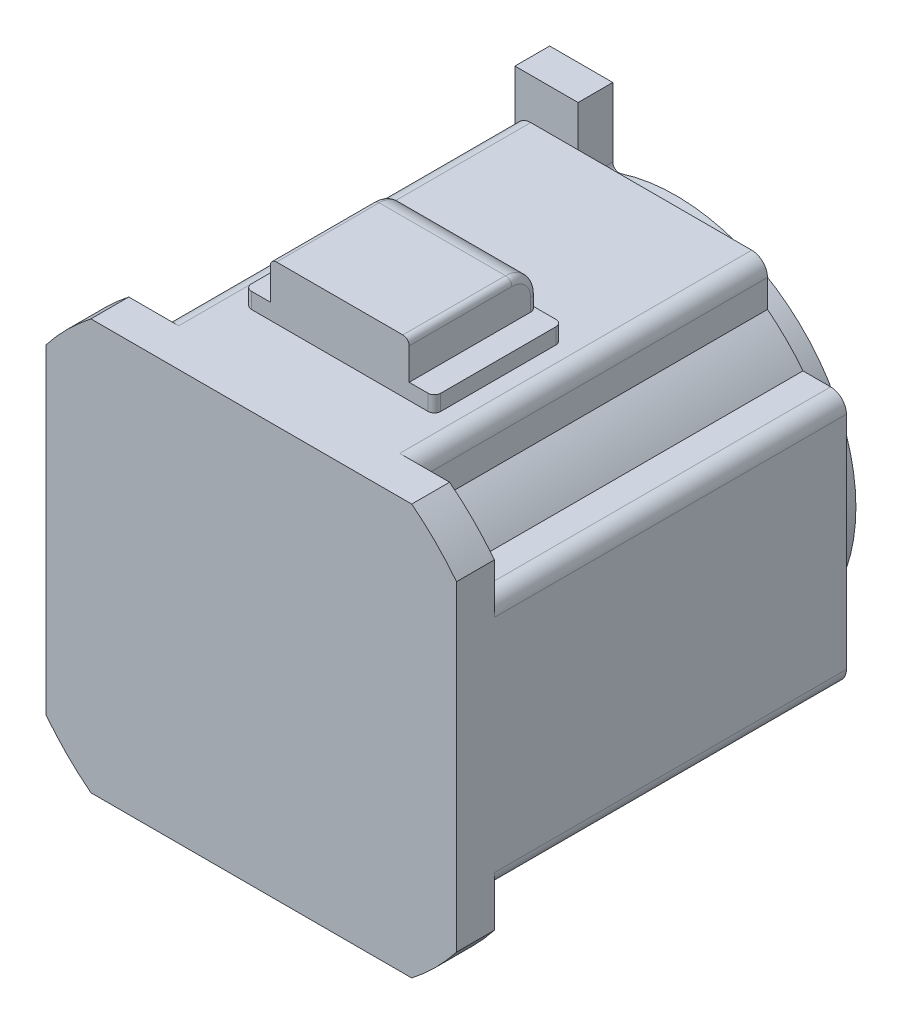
ISO-10303-21;
HEADER;
FILE_DESCRIPTION(('STEP AP214'),'2;1');
FILE_NAME('part.step','',(''),(''),'','','');
FILE_SCHEMA(('AUTOMOTIVE_DESIGN { 1 0 10303 214 1 1 1 1 }'));
ENDSEC;
DATA;
#1=APPLICATION_CONTEXT('core data for automotive mechanical design processes');
#2=APPLICATION_PROTOCOL_DEFINITION('international standard','automotive_design',2000,#1);
#3=PRODUCT_CONTEXT('',#1,'mechanical');
#4=PRODUCT('Part','Part','',(#3));
#5=PRODUCT_RELATED_PRODUCT_CATEGORY('part','',(#4));
#6=PRODUCT_DEFINITION_FORMATION('','',#4);
#7=PRODUCT_DEFINITION_CONTEXT('part definition',#1,'design');
#8=PRODUCT_DEFINITION('design','',#6,#7);
#9=PRODUCT_DEFINITION_SHAPE('','',#8);
#10=(LENGTH_UNIT() NAMED_UNIT(*) SI_UNIT(.MILLI.,.METRE.));
#11=(NAMED_UNIT(*) PLANE_ANGLE_UNIT() SI_UNIT($,.RADIAN.));
#12=(NAMED_UNIT(*) SI_UNIT($,.STERADIAN.) SOLID_ANGLE_UNIT());
#13=UNCERTAINTY_MEASURE_WITH_UNIT(LENGTH_MEASURE(1.E-05),#10,'distance_accuracy_value','');
#14=(GEOMETRIC_REPRESENTATION_CONTEXT(3) GLOBAL_UNCERTAINTY_ASSIGNED_CONTEXT((#13)) GLOBAL_UNIT_ASSIGNED_CONTEXT((#10,
#11,#12)) REPRESENTATION_CONTEXT('',''));
#15=CARTESIAN_POINT('',(0.,0.,0.));
#16=DIRECTION('',(0.,0.,1.));
#17=DIRECTION('',(1.,0.,0.));
#18=AXIS2_PLACEMENT_3D('',#15,#16,#17);
#19=CARTESIAN_POINT('',(0.,74.0000000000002,-63.5));
#20=DIRECTION('',(1.,0.,0.));
#21=DIRECTION('',(0.,0.,1.));
#22=AXIS2_PLACEMENT_3D('',#19,#20,#21);
#23=TOROIDAL_SURFACE('',#22,6.00000000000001,2.);
#24=CARTESIAN_POINT('',(0.,74.0000000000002,-69.5));
#25=DIRECTION('',(0.,1.,0.));
#26=DIRECTION('',(0.,0.,1.));
#27=AXIS2_PLACEMENT_3D('',#24,#25,#26);
#28=CIRCLE('',#27,2.);
#29=CARTESIAN_POINT('',(-2.,74.0000000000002,-69.5));
#30=VERTEX_POINT('',#29);
#31=CARTESIAN_POINT('',(0.,74.0000000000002,-71.5));
#32=VERTEX_POINT('',#31);
#33=EDGE_CURVE('E644',#30,#32,#28,.F.);
#34=ORIENTED_EDGE('',*,*,#33,.F.);
#35=CARTESIAN_POINT('',(-2.,74.0000000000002,-63.5));
#36=DIRECTION('',(1.,0.,0.));
#37=DIRECTION('',(0.,0.,-1.));
#38=AXIS2_PLACEMENT_3D('',#35,#36,#37);
#39=CIRCLE('',#38,6.00000000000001);
#40=CARTESIAN_POINT('',(-2.,80.0000000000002,-63.5));
#41=VERTEX_POINT('',#40);
#42=EDGE_CURVE('E713',#41,#30,#39,.F.);
#43=ORIENTED_EDGE('',*,*,#42,.F.);
#44=CARTESIAN_POINT('',(0.,80.0000000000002,-63.5));
#45=DIRECTION('',(0.,0.,-1.));
#46=DIRECTION('',(0.,1.,0.));
#47=AXIS2_PLACEMENT_3D('',#44,#45,#46);
#48=CIRCLE('',#47,2.);
#49=CARTESIAN_POINT('',(0.,82.0000000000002,-63.5));
#50=VERTEX_POINT('',#49);
#51=EDGE_CURVE('E714',#50,#41,#48,.F.);
#52=ORIENTED_EDGE('',*,*,#51,.F.);
#53=CARTESIAN_POINT('',(0.,74.0000000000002,-63.5));
#54=DIRECTION('',(1.,0.,0.));
#55=DIRECTION('',(0.,1.,0.));
#56=AXIS2_PLACEMENT_3D('',#53,#54,#55);
#57=CIRCLE('',#56,8.);
#58=EDGE_CURVE('E638',#32,#50,#57,.T.);
#59=ORIENTED_EDGE('',*,*,#58,.F.);
#60=EDGE_LOOP('',(#34,#43,#52,#59));
#61=FACE_BOUND('',#60,.T.);
#62=ADVANCED_FACE('F16',(#61),#23,.T.);
#63=CARTESIAN_POINT('',(40.,74.0000000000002,-63.5));
#64=DIRECTION('',(-1.,0.,0.));
#65=DIRECTION('',(0.,0.,-1.));
#66=AXIS2_PLACEMENT_3D('',#63,#64,#65);
#67=TOROIDAL_SURFACE('',#66,6.00000000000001,2.);
#68=CARTESIAN_POINT('',(40.,80.0000000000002,-63.5));
#69=DIRECTION('',(0.,0.,1.));
#70=DIRECTION('',(0.,-1.,0.));
#71=AXIS2_PLACEMENT_3D('',#68,#69,#70);
#72=CIRCLE('',#71,2.);
#73=CARTESIAN_POINT('',(42.,80.0000000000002,-63.5));
#74=VERTEX_POINT('',#73);
#75=CARTESIAN_POINT('',(40.,82.0000000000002,-63.5));
#76=VERTEX_POINT('',#75);
#77=EDGE_CURVE('E657',#74,#76,#72,.T.);
#78=ORIENTED_EDGE('',*,*,#77,.F.);
#79=CARTESIAN_POINT('',(42.,74.0000000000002,-63.5));
#80=DIRECTION('',(-1.,0.,0.));
#81=DIRECTION('',(0.,1.,0.));
#82=AXIS2_PLACEMENT_3D('',#79,#80,#81);
#83=CIRCLE('',#82,5.99999999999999);
#84=CARTESIAN_POINT('',(42.,74.0000000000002,-69.5));
#85=VERTEX_POINT('',#84);
#86=EDGE_CURVE('E667',#85,#74,#83,.F.);
#87=ORIENTED_EDGE('',*,*,#86,.F.);
#88=CARTESIAN_POINT('',(40.,74.0000000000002,-69.5));
#89=DIRECTION('',(0.,1.,0.));
#90=DIRECTION('',(0.,0.,1.));
#91=AXIS2_PLACEMENT_3D('',#88,#89,#90);
#92=CIRCLE('',#91,2.);
#93=CARTESIAN_POINT('',(40.,74.0000000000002,-71.5));
#94=VERTEX_POINT('',#93);
#95=EDGE_CURVE('E622',#94,#85,#92,.F.);
#96=ORIENTED_EDGE('',*,*,#95,.F.);
#97=CARTESIAN_POINT('',(40.,74.0000000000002,-63.5));
#98=DIRECTION('',(1.,0.,0.));
#99=DIRECTION('',(0.,1.,0.));
#100=AXIS2_PLACEMENT_3D('',#97,#98,#99);
#101=CIRCLE('',#100,8.);
#102=EDGE_CURVE('E626',#76,#94,#101,.F.);
#103=ORIENTED_EDGE('',*,*,#102,.F.);
#104=EDGE_LOOP('',(#78,#87,#96,#103));
#105=FACE_BOUND('',#104,.T.);
#106=ADVANCED_FACE('F752',(#105),#67,.T.);
#107=CARTESIAN_POINT('',(20.,1.9684254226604E-13,-137.5));
#108=DIRECTION('',(0.,0.,1.));
#109=DIRECTION('',(0.,-1.,0.));
#110=AXIS2_PLACEMENT_3D('',#107,#108,#109);
#111=PLANE('',#110);
#112=DIRECTION('',(0.,1.,0.));
#113=VECTOR('',#112,1.);
#114=CARTESIAN_POINT('',(-20.,65.0000000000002,-137.5));
#115=LINE('',#114,#113);
#116=CARTESIAN_POINT('',(-20.0000000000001,41.4366987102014,-137.5));
#117=VERTEX_POINT('',#116);
#118=CARTESIAN_POINT('',(-20.,78.0000000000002,-137.5));
#119=VERTEX_POINT('',#118);
#120=EDGE_CURVE('E347',#117,#119,#115,.T.);
#121=ORIENTED_EDGE('',*,*,#120,.T.);
#122=DIRECTION('',(1.,0.,0.));
#123=VECTOR('',#122,1.);
#124=CARTESIAN_POINT('',(-20.,78.0000000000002,-137.5));
#125=LINE('',#124,#123);
#126=CARTESIAN_POINT('',(0.,78.0000000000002,-137.5));
#127=VERTEX_POINT('',#126);
#128=EDGE_CURVE('E733',#127,#119,#125,.F.);
#129=ORIENTED_EDGE('',*,*,#128,.F.);
#130=DIRECTION('',(0.,1.,0.));
#131=VECTOR('',#130,1.);
#132=CARTESIAN_POINT('',(0.,78.0000000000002,-137.5));
#133=LINE('',#132,#131);
#134=CARTESIAN_POINT('',(0.,56.1871871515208,-137.5));
#135=VERTEX_POINT('',#134);
#136=EDGE_CURVE('E586',#135,#127,#133,.T.);
#137=ORIENTED_EDGE('',*,*,#136,.F.);
#138=CARTESIAN_POINT('',(2.,56.1871871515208,-137.5));
#139=DIRECTION('',(0.,0.,1.));
#140=DIRECTION('',(0.,-1.,0.));
#141=AXIS2_PLACEMENT_3D('',#138,#139,#140);
#142=CIRCLE('',#141,2.);
#143=CARTESIAN_POINT('',(2.61016949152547,54.2825367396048,-137.5));
#144=VERTEX_POINT('',#143);
#145=EDGE_CURVE('E587',#144,#135,#142,.F.);
#146=ORIENTED_EDGE('',*,*,#145,.F.);
#147=CARTESIAN_POINT('',(20.,1.95495475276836E-13,-137.5));
#148=DIRECTION('',(0.,0.,-1.));
#149=DIRECTION('',(0.,1.,0.));
#150=AXIS2_PLACEMENT_3D('',#147,#148,#149);
#151=CIRCLE('',#150,57.);
#152=CARTESIAN_POINT('',(-20.5762711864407,40.0320648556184,-137.5));
#153=VERTEX_POINT('',#152);
#154=EDGE_CURVE('E591',#153,#144,#151,.F.);
#155=ORIENTED_EDGE('',*,*,#154,.F.);
#156=CARTESIAN_POINT('',(-22.,41.4366987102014,-137.5));
#157=DIRECTION('',(0.,0.,-1.));
#158=DIRECTION('',(0.,1.,0.));
#159=AXIS2_PLACEMENT_3D('',#156,#157,#158);
#160=CIRCLE('',#159,2.);
#161=EDGE_CURVE('E340',#117,#153,#160,.T.);
#162=ORIENTED_EDGE('',*,*,#161,.F.);
#163=EDGE_LOOP('',(#121,#129,#137,#146,#155,#162));
#164=FACE_BOUND('',#163,.T.);
#165=ADVANCED_FACE('F756',(#164),#111,.F.);
#166=CARTESIAN_POINT('',(-22.,41.4366987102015,-126.5));
#167=DIRECTION('',(0.,0.,-1.));
#168=DIRECTION('',(0.,1.,0.));
#169=AXIS2_PLACEMENT_3D('',#166,#167,#168);
#170=CYLINDRICAL_SURFACE('',#169,2.);
#171=ORIENTED_EDGE('',*,*,#161,.T.);
#172=DIRECTION('',(0.,0.,-1.));
#173=VECTOR('',#172,1.);
#174=CARTESIAN_POINT('',(-20.5762711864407,40.0320648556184,-126.5));
#175=LINE('',#174,#173);
#176=CARTESIAN_POINT('',(-20.5762711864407,40.0320648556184,-126.5));
#177=VERTEX_POINT('',#176);
#178=EDGE_CURVE('E338',#177,#153,#175,.T.);
#179=ORIENTED_EDGE('',*,*,#178,.F.);
#180=CARTESIAN_POINT('',(-22.,41.4366987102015,-126.5));
#181=DIRECTION('',(0.,0.,-1.));
#182=DIRECTION('',(0.,1.,0.));
#183=AXIS2_PLACEMENT_3D('',#180,#181,#182);
#184=CIRCLE('',#183,2.);
#185=CARTESIAN_POINT('',(-20.,41.4366987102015,-126.5));
#186=VERTEX_POINT('',#185);
#187=EDGE_CURVE('E21',#177,#186,#184,.F.);
#188=ORIENTED_EDGE('',*,*,#187,.T.);
#189=DIRECTION('',(0.,0.,1.));
#190=VECTOR('',#189,1.);
#191=CARTESIAN_POINT('',(-20.0000000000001,41.4366987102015,-126.5));
#192=LINE('',#191,#190);
#193=EDGE_CURVE('E336',#186,#117,#192,.F.);
#194=ORIENTED_EDGE('',*,*,#193,.T.);
#195=EDGE_LOOP('',(#171,#179,#188,#194));
#196=FACE_BOUND('',#195,.T.);
#197=ADVANCED_FACE('F335',(#196),#170,.F.);
#198=CARTESIAN_POINT('',(-20.,78.0000000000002,-137.5));
#199=DIRECTION('',(0.,1.,0.));
#200=DIRECTION('',(0.,0.,1.));
#201=AXIS2_PLACEMENT_3D('',#198,#199,#200);
#202=PLANE('',#201);
#203=ORIENTED_EDGE('',*,*,#128,.T.);
#204=DIRECTION('',(0.,0.,1.));
#205=VECTOR('',#204,1.);
#206=CARTESIAN_POINT('',(-20.,78.0000000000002,-126.5));
#207=LINE('',#206,#205);
#208=CARTESIAN_POINT('',(-20.,78.0000000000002,-126.5));
#209=VERTEX_POINT('',#208);
#210=EDGE_CURVE('E555',#119,#209,#207,.T.);
#211=ORIENTED_EDGE('',*,*,#210,.T.);
#212=DIRECTION('',(1.,0.,0.));
#213=VECTOR('',#212,1.);
#214=CARTESIAN_POINT('',(-10.,78.0000000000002,-126.5));
#215=LINE('',#214,#213);
#216=CARTESIAN_POINT('',(0.,78.0000000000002,-126.5));
#217=VERTEX_POINT('',#216);
#218=EDGE_CURVE('E496',#209,#217,#215,.T.);
#219=ORIENTED_EDGE('',*,*,#218,.T.);
#220=DIRECTION('',(0.,0.,1.));
#221=VECTOR('',#220,1.);
#222=CARTESIAN_POINT('',(0.,78.0000000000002,-137.5));
#223=LINE('',#222,#221);
#224=EDGE_CURVE('E581',#127,#217,#223,.T.);
#225=ORIENTED_EDGE('',*,*,#224,.F.);
#226=EDGE_LOOP('',(#203,#211,#219,#225));
#227=FACE_BOUND('',#226,.T.);
#228=ADVANCED_FACE('F1157',(#227),#202,.T.);
#229=CARTESIAN_POINT('',(0.,80.0000000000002,-41.125));
#230=DIRECTION('',(0.,0.,-1.));
#231=DIRECTION('',(0.,1.,0.));
#232=AXIS2_PLACEMENT_3D('',#229,#230,#231);
#233=CYLINDRICAL_SURFACE('',#232,2.);
#234=ORIENTED_EDGE('',*,*,#51,.T.);
#235=DIRECTION('',(0.,0.,1.));
#236=VECTOR('',#235,1.);
#237=CARTESIAN_POINT('',(-2.,80.0000000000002,-31.));
#238=LINE('',#237,#236);
#239=CARTESIAN_POINT('',(-2.,80.0000000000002,-31.));
#240=VERTEX_POINT('',#239);
#241=EDGE_CURVE('E705',#240,#41,#238,.F.);
#242=ORIENTED_EDGE('',*,*,#241,.F.);
#243=CARTESIAN_POINT('',(0.,80.0000000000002,-31.));
#244=DIRECTION('',(0.,0.,-1.));
#245=DIRECTION('',(0.,1.,0.));
#246=AXIS2_PLACEMENT_3D('',#243,#244,#245);
#247=CIRCLE('',#246,2.);
#248=CARTESIAN_POINT('',(0.,82.0000000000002,-31.));
#249=VERTEX_POINT('',#248);
#250=EDGE_CURVE('E490',#249,#240,#247,.F.);
#251=ORIENTED_EDGE('',*,*,#250,.F.);
#252=DIRECTION('',(0.,0.,-1.));
#253=VECTOR('',#252,1.);
#254=CARTESIAN_POINT('',(0.,82.0000000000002,-51.25));
#255=LINE('',#254,#253);
#256=EDGE_CURVE('E647',#249,#50,#255,.T.);
#257=ORIENTED_EDGE('',*,*,#256,.T.);
#258=EDGE_LOOP('',(#234,#242,#251,#257));
#259=FACE_BOUND('',#258,.T.);
#260=ADVANCED_FACE('F699',(#259),#233,.T.);
#261=CARTESIAN_POINT('',(-2.,65.0000000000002,-31.));
#262=DIRECTION('',(-1.,0.,0.));
#263=DIRECTION('',(0.,0.,1.));
#264=AXIS2_PLACEMENT_3D('',#261,#262,#263);
#265=PLANE('',#264);
#266=DIRECTION('',(0.,0.,-1.));
#267=VECTOR('',#266,1.);
#268=CARTESIAN_POINT('',(-2.,70.0000000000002,-51.25));
#269=LINE('',#268,#267);
#270=CARTESIAN_POINT('',(-2.,70.0000000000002,-69.5));
#271=VERTEX_POINT('',#270);
#272=CARTESIAN_POINT('',(-2.,70.0000000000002,-31.));
#273=VERTEX_POINT('',#272);
#274=EDGE_CURVE('E602',#271,#273,#269,.F.);
#275=ORIENTED_EDGE('',*,*,#274,.T.);
#276=DIRECTION('',(0.,-1.,0.));
#277=VECTOR('',#276,1.);
#278=CARTESIAN_POINT('',(-2.,65.0000000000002,-31.));
#279=LINE('',#278,#277);
#280=EDGE_CURVE('E486',#240,#273,#279,.T.);
#281=ORIENTED_EDGE('',*,*,#280,.F.);
#282=ORIENTED_EDGE('',*,*,#241,.T.);
#283=ORIENTED_EDGE('',*,*,#42,.T.);
#284=DIRECTION('',(0.,1.,0.));
#285=VECTOR('',#284,1.);
#286=CARTESIAN_POINT('',(-2.,65.0000000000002,-69.5));
#287=LINE('',#286,#285);
#288=EDGE_CURVE('E641',#271,#30,#287,.T.);
#289=ORIENTED_EDGE('',*,*,#288,.F.);
#290=EDGE_LOOP('',(#275,#281,#282,#283,#289));
#291=FACE_BOUND('',#290,.T.);
#292=ADVANCED_FACE('F694',(#291),#265,.T.);
#293=CARTESIAN_POINT('',(42.,65.0000000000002,-71.5));
#294=DIRECTION('',(1.,0.,0.));
#295=DIRECTION('',(0.,1.,0.));
#296=AXIS2_PLACEMENT_3D('',#293,#294,#295);
#297=PLANE('',#296);
#298=DIRECTION('',(0.,-1.,0.));
#299=VECTOR('',#298,1.);
#300=CARTESIAN_POINT('',(42.,65.0000000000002,-31.));
#301=LINE('',#300,#299);
#302=CARTESIAN_POINT('',(42.,70.0000000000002,-31.));
#303=VERTEX_POINT('',#302);
#304=CARTESIAN_POINT('',(42.,80.0000000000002,-31.));
#305=VERTEX_POINT('',#304);
#306=EDGE_CURVE('E481',#303,#305,#301,.F.);
#307=ORIENTED_EDGE('',*,*,#306,.F.);
#308=DIRECTION('',(0.,0.,-1.));
#309=VECTOR('',#308,1.);
#310=CARTESIAN_POINT('',(42.,70.0000000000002,-51.25));
#311=LINE('',#310,#309);
#312=CARTESIAN_POINT('',(42.,70.0000000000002,-69.5));
#313=VERTEX_POINT('',#312);
#314=EDGE_CURVE('E599',#303,#313,#311,.T.);
#315=ORIENTED_EDGE('',*,*,#314,.T.);
#316=DIRECTION('',(0.,1.,0.));
#317=VECTOR('',#316,1.);
#318=CARTESIAN_POINT('',(42.,65.0000000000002,-69.5));
#319=LINE('',#318,#317);
#320=EDGE_CURVE('E625',#85,#313,#319,.F.);
#321=ORIENTED_EDGE('',*,*,#320,.F.);
#322=ORIENTED_EDGE('',*,*,#86,.T.);
#323=DIRECTION('',(0.,0.,1.));
#324=VECTOR('',#323,1.);
#325=CARTESIAN_POINT('',(42.,80.0000000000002,-61.375));
#326=LINE('',#325,#324);
#327=EDGE_CURVE('E664',#305,#74,#326,.F.);
#328=ORIENTED_EDGE('',*,*,#327,.F.);
#329=EDGE_LOOP('',(#307,#315,#321,#322,#328));
#330=FACE_BOUND('',#329,.T.);
#331=ADVANCED_FACE('F683',(#330),#297,.T.);
#332=CARTESIAN_POINT('',(40.,80.0000000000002,-61.375));
#333=DIRECTION('',(0.,0.,1.));
#334=DIRECTION('',(0.,-1.,0.));
#335=AXIS2_PLACEMENT_3D('',#332,#333,#334);
#336=CYLINDRICAL_SURFACE('',#335,2.);
#337=ORIENTED_EDGE('',*,*,#77,.T.);
#338=DIRECTION('',(0.,0.,-1.));
#339=VECTOR('',#338,1.);
#340=CARTESIAN_POINT('',(40.,82.0000000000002,-51.25));
#341=LINE('',#340,#339);
#342=CARTESIAN_POINT('',(40.,82.0000000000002,-31.));
#343=VERTEX_POINT('',#342);
#344=EDGE_CURVE('E654',#76,#343,#341,.F.);
#345=ORIENTED_EDGE('',*,*,#344,.T.);
#346=CARTESIAN_POINT('',(40.,80.0000000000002,-31.));
#347=DIRECTION('',(0.,0.,1.));
#348=DIRECTION('',(0.,-1.,0.));
#349=AXIS2_PLACEMENT_3D('',#346,#347,#348);
#350=CIRCLE('',#349,2.);
#351=EDGE_CURVE('E480',#305,#343,#350,.T.);
#352=ORIENTED_EDGE('',*,*,#351,.F.);
#353=ORIENTED_EDGE('',*,*,#327,.T.);
#354=EDGE_LOOP('',(#337,#345,#352,#353));
#355=FACE_BOUND('',#354,.T.);
#356=ADVANCED_FACE('F693',(#355),#336,.T.);
#357=CARTESIAN_POINT('',(20.,82.0000000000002,-51.25));
#358=DIRECTION('',(0.,-1.,0.));
#359=DIRECTION('',(0.,0.,-1.));
#360=AXIS2_PLACEMENT_3D('',#357,#358,#359);
#361=PLANE('',#360);
#362=DIRECTION('',(1.,0.,0.));
#363=VECTOR('',#362,1.);
#364=CARTESIAN_POINT('',(42.,82.0000000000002,-31.));
#365=LINE('',#364,#363);
#366=EDGE_CURVE('E477',#343,#249,#365,.F.);
#367=ORIENTED_EDGE('',*,*,#366,.F.);
#368=ORIENTED_EDGE('',*,*,#344,.F.);
#369=DIRECTION('',(1.,0.,0.));
#370=VECTOR('',#369,1.);
#371=CARTESIAN_POINT('',(20.,82.0000000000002,-63.5));
#372=LINE('',#371,#370);
#373=EDGE_CURVE('E635',#50,#76,#372,.T.);
#374=ORIENTED_EDGE('',*,*,#373,.F.);
#375=ORIENTED_EDGE('',*,*,#256,.F.);
#376=EDGE_LOOP('',(#367,#368,#374,#375));
#377=FACE_BOUND('',#376,.T.);
#378=ADVANCED_FACE('F1189',(#377),#361,.F.);
#379=CARTESIAN_POINT('',(0.,65.0000000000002,-69.5));
#380=DIRECTION('',(0.,1.,0.));
#381=DIRECTION('',(0.,0.,1.));
#382=AXIS2_PLACEMENT_3D('',#379,#380,#381);
#383=CYLINDRICAL_SURFACE('',#382,2.);
#384=CARTESIAN_POINT('',(0.,70.0000000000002,-69.5));
#385=DIRECTION('',(0.,1.,0.));
#386=DIRECTION('',(0.,0.,1.));
#387=AXIS2_PLACEMENT_3D('',#384,#385,#386);
#388=CIRCLE('',#387,2.);
#389=CARTESIAN_POINT('',(0.,70.0000000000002,-71.5));
#390=VERTEX_POINT('',#389);
#391=EDGE_CURVE('E609',#390,#271,#388,.T.);
#392=ORIENTED_EDGE('',*,*,#391,.T.);
#393=ORIENTED_EDGE('',*,*,#288,.T.);
#394=ORIENTED_EDGE('',*,*,#33,.T.);
#395=DIRECTION('',(0.,1.,0.));
#396=VECTOR('',#395,1.);
#397=CARTESIAN_POINT('',(0.,65.0000000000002,-71.5));
#398=LINE('',#397,#396);
#399=EDGE_CURVE('E467',#390,#32,#398,.T.);
#400=ORIENTED_EDGE('',*,*,#399,.F.);
#401=EDGE_LOOP('',(#392,#393,#394,#400));
#402=FACE_BOUND('',#401,.T.);
#403=ADVANCED_FACE('F1204',(#402),#383,.T.);
#404=CARTESIAN_POINT('',(20.,74.0000000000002,-63.5));
#405=DIRECTION('',(1.,0.,0.));
#406=DIRECTION('',(0.,1.,0.));
#407=AXIS2_PLACEMENT_3D('',#404,#405,#406);
#408=CYLINDRICAL_SURFACE('',#407,8.);
#409=ORIENTED_EDGE('',*,*,#102,.T.);
#410=DIRECTION('',(1.,0.,0.));
#411=VECTOR('',#410,1.);
#412=CARTESIAN_POINT('',(20.,74.0000000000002,-71.5));
#413=LINE('',#412,#411);
#414=EDGE_CURVE('E616',#32,#94,#413,.T.);
#415=ORIENTED_EDGE('',*,*,#414,.F.);
#416=ORIENTED_EDGE('',*,*,#58,.T.);
#417=ORIENTED_EDGE('',*,*,#373,.T.);
#418=EDGE_LOOP('',(#409,#415,#416,#417));
#419=FACE_BOUND('',#418,.T.);
#420=ADVANCED_FACE('F1182',(#419),#408,.T.);
#421=CARTESIAN_POINT('',(40.,65.0000000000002,-69.5));
#422=DIRECTION('',(0.,1.,0.));
#423=DIRECTION('',(0.,0.,1.));
#424=AXIS2_PLACEMENT_3D('',#421,#422,#423);
#425=CYLINDRICAL_SURFACE('',#424,2.);
#426=ORIENTED_EDGE('',*,*,#95,.T.);
#427=ORIENTED_EDGE('',*,*,#320,.T.);
#428=CARTESIAN_POINT('',(40.,70.0000000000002,-69.5));
#429=DIRECTION('',(0.,1.,0.));
#430=DIRECTION('',(0.,0.,1.));
#431=AXIS2_PLACEMENT_3D('',#428,#429,#430);
#432=CIRCLE('',#431,2.);
#433=CARTESIAN_POINT('',(40.,70.0000000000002,-71.5));
#434=VERTEX_POINT('',#433);
#435=EDGE_CURVE('E593',#313,#434,#432,.T.);
#436=ORIENTED_EDGE('',*,*,#435,.T.);
#437=DIRECTION('',(0.,1.,0.));
#438=VECTOR('',#437,1.);
#439=CARTESIAN_POINT('',(40.,65.0000000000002,-71.5));
#440=LINE('',#439,#438);
#441=EDGE_CURVE('E606',#94,#434,#440,.F.);
#442=ORIENTED_EDGE('',*,*,#441,.F.);
#443=EDGE_LOOP('',(#426,#427,#436,#442));
#444=FACE_BOUND('',#443,.T.);
#445=ADVANCED_FACE('F1230',(#444),#425,.T.);
#446=CARTESIAN_POINT('',(-6.,70.0000000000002,-51.25));
#447=DIRECTION('',(0.,-1.,0.));
#448=DIRECTION('',(0.,0.,-1.));
#449=AXIS2_PLACEMENT_3D('',#446,#447,#448);
#450=PLANE('',#449);
#451=DIRECTION('',(1.,0.,0.));
#452=VECTOR('',#451,1.);
#453=CARTESIAN_POINT('',(42.,70.0000000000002,-31.));
#454=LINE('',#453,#452);
#455=CARTESIAN_POINT('',(-8.,70.0000000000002,-31.));
#456=VERTEX_POINT('',#455);
#457=EDGE_CURVE('E489',#273,#456,#454,.F.);
#458=ORIENTED_EDGE('',*,*,#457,.F.);
#459=ORIENTED_EDGE('',*,*,#274,.F.);
#460=ORIENTED_EDGE('',*,*,#391,.F.);
#461=DIRECTION('',(1.,0.,0.));
#462=VECTOR('',#461,1.);
#463=CARTESIAN_POINT('',(20.,70.0000000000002,-71.5));
#464=LINE('',#463,#462);
#465=CARTESIAN_POINT('',(-8.,70.0000000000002,-71.5));
#466=VERTEX_POINT('',#465);
#467=EDGE_CURVE('E462',#466,#390,#464,.T.);
#468=ORIENTED_EDGE('',*,*,#467,.F.);
#469=CARTESIAN_POINT('',(-8.,70.0000000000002,-69.5));
#470=DIRECTION('',(0.,1.,0.));
#471=DIRECTION('',(0.,0.,1.));
#472=AXIS2_PLACEMENT_3D('',#469,#470,#471);
#473=CIRCLE('',#472,2.);
#474=CARTESIAN_POINT('',(-10.,70.0000000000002,-69.5));
#475=VERTEX_POINT('',#474);
#476=EDGE_CURVE('E468',#475,#466,#473,.F.);
#477=ORIENTED_EDGE('',*,*,#476,.F.);
#478=DIRECTION('',(0.,0.,1.));
#479=VECTOR('',#478,1.);
#480=CARTESIAN_POINT('',(-10.,70.0000000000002,-31.));
#481=LINE('',#480,#479);
#482=CARTESIAN_POINT('',(-10.,70.0000000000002,-33.));
#483=VERTEX_POINT('',#482);
#484=EDGE_CURVE('E472',#483,#475,#481,.F.);
#485=ORIENTED_EDGE('',*,*,#484,.F.);
#486=CARTESIAN_POINT('',(-8.,70.0000000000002,-33.));
#487=DIRECTION('',(0.,1.,0.));
#488=DIRECTION('',(0.,0.,1.));
#489=AXIS2_PLACEMENT_3D('',#486,#487,#488);
#490=CIRCLE('',#489,2.);
#491=EDGE_CURVE('E476',#456,#483,#490,.F.);
#492=ORIENTED_EDGE('',*,*,#491,.F.);
#493=EDGE_LOOP('',(#458,#459,#460,#468,#477,#485,#492));
#494=FACE_BOUND('',#493,.T.);
#495=ADVANCED_FACE('F1209',(#494),#450,.F.);
#496=CARTESIAN_POINT('',(46.,70.0000000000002,-51.25));
#497=DIRECTION('',(0.,-1.,0.));
#498=DIRECTION('',(0.,0.,-1.));
#499=AXIS2_PLACEMENT_3D('',#496,#497,#498);
#500=PLANE('',#499);
#501=DIRECTION('',(0.,0.,-1.));
#502=VECTOR('',#501,1.);
#503=CARTESIAN_POINT('',(50.,70.0000000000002,-71.5));
#504=LINE('',#503,#502);
#505=CARTESIAN_POINT('',(50.,70.0000000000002,-69.5));
#506=VERTEX_POINT('',#505);
#507=CARTESIAN_POINT('',(50.,70.0000000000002,-33.));
#508=VERTEX_POINT('',#507);
#509=EDGE_CURVE('E454',#506,#508,#504,.F.);
#510=ORIENTED_EDGE('',*,*,#509,.F.);
#511=CARTESIAN_POINT('',(48.,70.0000000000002,-69.5));
#512=DIRECTION('',(0.,1.,0.));
#513=DIRECTION('',(0.,0.,1.));
#514=AXIS2_PLACEMENT_3D('',#511,#512,#513);
#515=CIRCLE('',#514,2.);
#516=CARTESIAN_POINT('',(48.,70.0000000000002,-71.5));
#517=VERTEX_POINT('',#516);
#518=EDGE_CURVE('E458',#517,#506,#515,.F.);
#519=ORIENTED_EDGE('',*,*,#518,.F.);
#520=DIRECTION('',(1.,0.,0.));
#521=VECTOR('',#520,1.);
#522=CARTESIAN_POINT('',(20.,70.0000000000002,-71.5));
#523=LINE('',#522,#521);
#524=EDGE_CURVE('E463',#434,#517,#523,.T.);
#525=ORIENTED_EDGE('',*,*,#524,.F.);
#526=ORIENTED_EDGE('',*,*,#435,.F.);
#527=ORIENTED_EDGE('',*,*,#314,.F.);
#528=DIRECTION('',(1.,0.,0.));
#529=VECTOR('',#528,1.);
#530=CARTESIAN_POINT('',(42.,70.0000000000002,-31.));
#531=LINE('',#530,#529);
#532=CARTESIAN_POINT('',(48.,70.0000000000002,-31.));
#533=VERTEX_POINT('',#532);
#534=EDGE_CURVE('E483',#533,#303,#531,.F.);
#535=ORIENTED_EDGE('',*,*,#534,.F.);
#536=CARTESIAN_POINT('',(48.,70.0000000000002,-33.));
#537=DIRECTION('',(0.,1.,0.));
#538=DIRECTION('',(0.,0.,1.));
#539=AXIS2_PLACEMENT_3D('',#536,#537,#538);
#540=CIRCLE('',#539,2.);
#541=EDGE_CURVE('E448',#508,#533,#540,.F.);
#542=ORIENTED_EDGE('',*,*,#541,.F.);
#543=EDGE_LOOP('',(#510,#519,#525,#526,#527,#535,#542));
#544=FACE_BOUND('',#543,.T.);
#545=ADVANCED_FACE('F1226',(#544),#500,.F.);
#546=CARTESIAN_POINT('',(20.,1.99285032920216E-13,-126.5));
#547=DIRECTION('',(0.,0.,-1.));
#548=DIRECTION('',(0.,1.,0.));
#549=AXIS2_PLACEMENT_3D('',#546,#547,#548);
#550=CYLINDRICAL_SURFACE('',#549,57.);
#551=DIRECTION('',(0.,0.,1.));
#552=VECTOR('',#551,1.);
#553=CARTESIAN_POINT('',(2.61016949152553,54.2825367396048,-126.5));
#554=LINE('',#553,#552);
#555=CARTESIAN_POINT('',(2.61016949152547,54.2825367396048,-126.5));
#556=VERTEX_POINT('',#555);
#557=EDGE_CURVE('E588',#556,#144,#554,.F.);
#558=ORIENTED_EDGE('',*,*,#557,.F.);
#559=CARTESIAN_POINT('',(20.,1.99285032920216E-13,-126.5));
#560=DIRECTION('',(0.,0.,-1.));
#561=DIRECTION('',(0.,1.,0.));
#562=AXIS2_PLACEMENT_3D('',#559,#560,#561);
#563=CIRCLE('',#562,57.);
#564=EDGE_CURVE('E546',#177,#556,#563,.F.);
#565=ORIENTED_EDGE('',*,*,#564,.F.);
#566=ORIENTED_EDGE('',*,*,#178,.T.);
#567=ORIENTED_EDGE('',*,*,#154,.T.);
#568=EDGE_LOOP('',(#558,#565,#566,#567));
#569=FACE_BOUND('',#568,.T.);
#570=ADVANCED_FACE('F865',(#569),#550,.T.);
#571=CARTESIAN_POINT('',(2.,56.1871871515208,-137.5));
#572=DIRECTION('',(0.,0.,1.));
#573=DIRECTION('',(0.,-1.,0.));
#574=AXIS2_PLACEMENT_3D('',#571,#572,#573);
#575=CYLINDRICAL_SURFACE('',#574,2.);
#576=ORIENTED_EDGE('',*,*,#145,.T.);
#577=DIRECTION('',(0.,0.,1.));
#578=VECTOR('',#577,1.);
#579=CARTESIAN_POINT('',(0.,56.1871871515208,-137.5));
#580=LINE('',#579,#578);
#581=CARTESIAN_POINT('',(0.,56.1871871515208,-126.5));
#582=VERTEX_POINT('',#581);
#583=EDGE_CURVE('E583',#582,#135,#580,.F.);
#584=ORIENTED_EDGE('',*,*,#583,.F.);
#585=CARTESIAN_POINT('',(2.,56.1871871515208,-126.5));
#586=DIRECTION('',(0.,0.,1.));
#587=DIRECTION('',(0.,-1.,0.));
#588=AXIS2_PLACEMENT_3D('',#585,#586,#587);
#589=CIRCLE('',#588,2.);
#590=EDGE_CURVE('E393',#556,#582,#589,.F.);
#591=ORIENTED_EDGE('',*,*,#590,.F.);
#592=ORIENTED_EDGE('',*,*,#557,.T.);
#593=EDGE_LOOP('',(#576,#584,#591,#592));
#594=FACE_BOUND('',#593,.T.);
#595=ADVANCED_FACE('F871',(#594),#575,.F.);
#596=CARTESIAN_POINT('',(0.,78.0000000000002,-137.5));
#597=DIRECTION('',(1.,0.,0.));
#598=DIRECTION('',(0.,1.,0.));
#599=AXIS2_PLACEMENT_3D('',#596,#597,#598);
#600=PLANE('',#599);
#601=DIRECTION('',(0.,1.,0.));
#602=VECTOR('',#601,1.);
#603=CARTESIAN_POINT('',(0.,59.3039405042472,-126.5));
#604=LINE('',#603,#602);
#605=CARTESIAN_POINT('',(0.,65.0000000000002,-126.5));
#606=VERTEX_POINT('',#605);
#607=EDGE_CURVE('E511',#217,#606,#604,.F.);
#608=ORIENTED_EDGE('',*,*,#607,.T.);
#609=DIRECTION('',(0.,1.,0.));
#610=VECTOR('',#609,1.);
#611=CARTESIAN_POINT('',(0.,1.99285032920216E-13,-126.5));
#612=LINE('',#611,#610);
#613=EDGE_CURVE('E390',#582,#606,#612,.T.);
#614=ORIENTED_EDGE('',*,*,#613,.F.);
#615=ORIENTED_EDGE('',*,*,#583,.T.);
#616=ORIENTED_EDGE('',*,*,#136,.T.);
#617=ORIENTED_EDGE('',*,*,#224,.T.);
#618=EDGE_LOOP('',(#608,#614,#615,#616,#617));
#619=FACE_BOUND('',#618,.T.);
#620=ADVANCED_FACE('F875',(#619),#600,.T.);
#621=CARTESIAN_POINT('',(60.,51.2347538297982,-126.5));
#622=DIRECTION('',(-1.,0.,0.));
#623=DIRECTION('',(0.,-1.,0.));
#624=AXIS2_PLACEMENT_3D('',#621,#622,#623);
#625=PLANE('',#624);
#626=DIRECTION('',(0.,1.,0.));
#627=VECTOR('',#626,1.);
#628=CARTESIAN_POINT('',(60.,53.6922236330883,-15.));
#629=LINE('',#628,#627);
#630=CARTESIAN_POINT('',(60.,51.2347538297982,-15.));
#631=VERTEX_POINT('',#630);
#632=CARTESIAN_POINT('',(60.,60.0000000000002,-15.));
#633=VERTEX_POINT('',#632);
#634=EDGE_CURVE('E433',#631,#633,#629,.T.);
#635=ORIENTED_EDGE('',*,*,#634,.F.);
#636=DIRECTION('',(0.,0.,1.));
#637=VECTOR('',#636,1.);
#638=CARTESIAN_POINT('',(60.,51.2347538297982,-126.5));
#639=LINE('',#638,#637);
#640=CARTESIAN_POINT('',(60.,51.2347538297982,-126.5));
#641=VERTEX_POINT('',#640);
#642=EDGE_CURVE('E578',#631,#641,#639,.F.);
#643=ORIENTED_EDGE('',*,*,#642,.T.);
#644=DIRECTION('',(0.,1.,0.));
#645=VECTOR('',#644,1.);
#646=CARTESIAN_POINT('',(60.,1.99285032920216E-13,-126.5));
#647=LINE('',#646,#645);
#648=CARTESIAN_POINT('',(60.,60.0000000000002,-126.5));
#649=VERTEX_POINT('',#648);
#650=EDGE_CURVE('E387',#649,#641,#647,.F.);
#651=ORIENTED_EDGE('',*,*,#650,.F.);
#652=DIRECTION('',(0.,0.,-1.));
#653=VECTOR('',#652,1.);
#654=CARTESIAN_POINT('',(60.,60.0000000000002,-126.5));
#655=LINE('',#654,#653);
#656=EDGE_CURVE('E497',#633,#649,#655,.T.);
#657=ORIENTED_EDGE('',*,*,#656,.F.);
#658=EDGE_LOOP('',(#635,#643,#651,#657));
#659=FACE_BOUND('',#658,.T.);
#660=ADVANCED_FACE('F894',(#659),#625,.F.);
#661=CARTESIAN_POINT('',(20.,1.95304930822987E-13,-126.5));
#662=DIRECTION('',(0.,0.,1.));
#663=DIRECTION('',(0.,-1.,0.));
#664=AXIS2_PLACEMENT_3D('',#661,#662,#663);
#665=CYLINDRICAL_SURFACE('',#664,65.);
#666=DIRECTION('',(0.,0.,1.));
#667=VECTOR('',#666,1.);
#668=CARTESIAN_POINT('',(71.2347538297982,40.0000000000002,-126.5));
#669=LINE('',#668,#667);
#670=CARTESIAN_POINT('',(71.2347538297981,40.0000000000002,-15.));
#671=VERTEX_POINT('',#670);
#672=CARTESIAN_POINT('',(71.2347538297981,40.0000000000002,-126.5));
#673=VERTEX_POINT('',#672);
#674=EDGE_CURVE('E571',#671,#673,#669,.F.);
#675=ORIENTED_EDGE('',*,*,#674,.T.);
#676=CARTESIAN_POINT('',(20.,1.95304930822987E-13,-126.5));
#677=DIRECTION('',(0.,0.,1.));
#678=DIRECTION('',(0.,-1.,0.));
#679=AXIS2_PLACEMENT_3D('',#676,#677,#678);
#680=CIRCLE('',#679,65.);
#681=EDGE_CURVE('E386',#641,#673,#680,.F.);
#682=ORIENTED_EDGE('',*,*,#681,.F.);
#683=ORIENTED_EDGE('',*,*,#642,.F.);
#684=CARTESIAN_POINT('',(20.,2.33717265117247E-13,-15.));
#685=DIRECTION('',(0.,0.,1.));
#686=DIRECTION('',(0.,-1.,0.));
#687=AXIS2_PLACEMENT_3D('',#684,#685,#686);
#688=CIRCLE('',#687,65.);
#689=EDGE_CURVE('E436',#671,#631,#688,.T.);
#690=ORIENTED_EDGE('',*,*,#689,.F.);
#691=EDGE_LOOP('',(#675,#682,#683,#690));
#692=FACE_BOUND('',#691,.T.);
#693=ADVANCED_FACE('F898',(#692),#665,.T.);
#694=CARTESIAN_POINT('',(85.,40.0000000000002,-126.5));
#695=DIRECTION('',(0.,-1.,0.));
#696=DIRECTION('',(1.,0.,0.));
#697=AXIS2_PLACEMENT_3D('',#694,#695,#696);
#698=PLANE('',#697);
#699=DIRECTION('',(1.,0.,0.));
#700=VECTOR('',#699,1.);
#701=CARTESIAN_POINT('',(20.,40.0000000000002,-126.5));
#702=LINE('',#701,#700);
#703=CARTESIAN_POINT('',(80.,40.0000000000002,-126.5));
#704=VERTEX_POINT('',#703);
#705=EDGE_CURVE('E383',#673,#704,#702,.T.);
#706=ORIENTED_EDGE('',*,*,#705,.F.);
#707=ORIENTED_EDGE('',*,*,#674,.F.);
#708=DIRECTION('',(1.,0.,0.));
#709=VECTOR('',#708,1.);
#710=CARTESIAN_POINT('',(73.6922236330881,40.0000000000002,-15.));
#711=LINE('',#710,#709);
#712=CARTESIAN_POINT('',(80.,40.0000000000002,-15.));
#713=VERTEX_POINT('',#712);
#714=EDGE_CURVE('E437',#713,#671,#711,.F.);
#715=ORIENTED_EDGE('',*,*,#714,.F.);
#716=DIRECTION('',(0.,0.,1.));
#717=VECTOR('',#716,1.);
#718=CARTESIAN_POINT('',(80.,40.0000000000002,-126.5));
#719=LINE('',#718,#717);
#720=EDGE_CURVE('E574',#704,#713,#719,.T.);
#721=ORIENTED_EDGE('',*,*,#720,.F.);
#722=EDGE_LOOP('',(#706,#707,#715,#721));
#723=FACE_BOUND('',#722,.T.);
#724=ADVANCED_FACE('F905',(#723),#698,.F.);
#725=CARTESIAN_POINT('',(71.2347538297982,-39.9999999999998,-126.5));
#726=DIRECTION('',(0.,1.,0.));
#727=DIRECTION('',(0.,0.,1.));
#728=AXIS2_PLACEMENT_3D('',#725,#726,#727);
#729=PLANE('',#728);
#730=DIRECTION('',(1.,0.,0.));
#731=VECTOR('',#730,1.);
#732=CARTESIAN_POINT('',(73.6922236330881,-39.9999999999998,-15.));
#733=LINE('',#732,#731);
#734=CARTESIAN_POINT('',(71.234753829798,-39.9999999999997,-15.));
#735=VERTEX_POINT('',#734);
#736=CARTESIAN_POINT('',(80.,-39.9999999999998,-15.));
#737=VERTEX_POINT('',#736);
#738=EDGE_CURVE('E409',#735,#737,#733,.T.);
#739=ORIENTED_EDGE('',*,*,#738,.F.);
#740=DIRECTION('',(0.,0.,1.));
#741=VECTOR('',#740,1.);
#742=CARTESIAN_POINT('',(71.2347538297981,-39.9999999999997,-126.5));
#743=LINE('',#742,#741);
#744=CARTESIAN_POINT('',(71.234753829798,-39.9999999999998,-126.5));
#745=VERTEX_POINT('',#744);
#746=EDGE_CURVE('E568',#735,#745,#743,.F.);
#747=ORIENTED_EDGE('',*,*,#746,.T.);
#748=DIRECTION('',(1.,0.,0.));
#749=VECTOR('',#748,1.);
#750=CARTESIAN_POINT('',(20.,-39.9999999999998,-126.5));
#751=LINE('',#750,#749);
#752=CARTESIAN_POINT('',(80.,-39.9999999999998,-126.5));
#753=VERTEX_POINT('',#752);
#754=EDGE_CURVE('E380',#753,#745,#751,.F.);
#755=ORIENTED_EDGE('',*,*,#754,.F.);
#756=DIRECTION('',(0.,0.,-1.));
#757=VECTOR('',#756,1.);
#758=CARTESIAN_POINT('',(80.,-39.9999999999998,-126.5));
#759=LINE('',#758,#757);
#760=EDGE_CURVE('E572',#737,#753,#759,.T.);
#761=ORIENTED_EDGE('',*,*,#760,.F.);
#762=EDGE_LOOP('',(#739,#747,#755,#761));
#763=FACE_BOUND('',#762,.T.);
#764=ADVANCED_FACE('F1029',(#763),#729,.F.);
#765=CARTESIAN_POINT('',(20.,1.95304930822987E-13,-126.5));
#766=DIRECTION('',(0.,0.,1.));
#767=DIRECTION('',(0.,-1.,0.));
#768=AXIS2_PLACEMENT_3D('',#765,#766,#767);
#769=CYLINDRICAL_SURFACE('',#768,65.);
#770=DIRECTION('',(0.,0.,1.));
#771=VECTOR('',#770,1.);
#772=CARTESIAN_POINT('',(60.,-51.2347538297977,-126.5));
#773=LINE('',#772,#771);
#774=CARTESIAN_POINT('',(60.,-51.2347538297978,-15.));
#775=VERTEX_POINT('',#774);
#776=CARTESIAN_POINT('',(60.,-51.2347538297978,-126.5));
#777=VERTEX_POINT('',#776);
#778=EDGE_CURVE('E560',#775,#777,#773,.F.);
#779=ORIENTED_EDGE('',*,*,#778,.T.);
#780=CARTESIAN_POINT('',(20.,1.95304930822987E-13,-126.5));
#781=DIRECTION('',(0.,0.,1.));
#782=DIRECTION('',(0.,-1.,0.));
#783=AXIS2_PLACEMENT_3D('',#780,#781,#782);
#784=CIRCLE('',#783,65.);
#785=EDGE_CURVE('E379',#745,#777,#784,.F.);
#786=ORIENTED_EDGE('',*,*,#785,.F.);
#787=ORIENTED_EDGE('',*,*,#746,.F.);
#788=CARTESIAN_POINT('',(20.,2.33717265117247E-13,-15.));
#789=DIRECTION('',(0.,0.,1.));
#790=DIRECTION('',(0.,-1.,0.));
#791=AXIS2_PLACEMENT_3D('',#788,#789,#790);
#792=CIRCLE('',#791,65.);
#793=EDGE_CURVE('E412',#775,#735,#792,.T.);
#794=ORIENTED_EDGE('',*,*,#793,.F.);
#795=EDGE_LOOP('',(#779,#786,#787,#794));
#796=FACE_BOUND('',#795,.T.);
#797=ADVANCED_FACE('F1033',(#796),#769,.T.);
#798=CARTESIAN_POINT('',(60.,-64.9999999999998,-126.5));
#799=DIRECTION('',(-1.,0.,0.));
#800=DIRECTION('',(0.,-1.,0.));
#801=AXIS2_PLACEMENT_3D('',#798,#799,#800);
#802=PLANE('',#801);
#803=DIRECTION('',(0.,1.,0.));
#804=VECTOR('',#803,1.);
#805=CARTESIAN_POINT('',(60.,1.99285032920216E-13,-126.5));
#806=LINE('',#805,#804);
#807=CARTESIAN_POINT('',(60.,-59.9999999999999,-126.5));
#808=VERTEX_POINT('',#807);
#809=EDGE_CURVE('E376',#777,#808,#806,.F.);
#810=ORIENTED_EDGE('',*,*,#809,.F.);
#811=ORIENTED_EDGE('',*,*,#778,.F.);
#812=DIRECTION('',(0.,1.,0.));
#813=VECTOR('',#812,1.);
#814=CARTESIAN_POINT('',(60.,-53.6922236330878,-15.));
#815=LINE('',#814,#813);
#816=CARTESIAN_POINT('',(60.,-59.9999999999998,-15.));
#817=VERTEX_POINT('',#816);
#818=EDGE_CURVE('E413',#817,#775,#815,.T.);
#819=ORIENTED_EDGE('',*,*,#818,.F.);
#820=DIRECTION('',(0.,0.,1.));
#821=VECTOR('',#820,1.);
#822=CARTESIAN_POINT('',(60.,-59.9999999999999,-126.5));
#823=LINE('',#822,#821);
#824=EDGE_CURVE('E563',#808,#817,#823,.T.);
#825=ORIENTED_EDGE('',*,*,#824,.F.);
#826=EDGE_LOOP('',(#810,#811,#819,#825));
#827=FACE_BOUND('',#826,.T.);
#828=ADVANCED_FACE('F1035',(#827),#802,.F.);
#829=CARTESIAN_POINT('',(-31.234753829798,40.0000000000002,-126.5));
#830=DIRECTION('',(0.,-1.,0.));
#831=DIRECTION('',(1.,0.,0.));
#832=AXIS2_PLACEMENT_3D('',#829,#830,#831);
#833=PLANE('',#832);
#834=DIRECTION('',(1.,0.,0.));
#835=VECTOR('',#834,1.);
#836=CARTESIAN_POINT('',(-33.6922236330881,40.0000000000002,-15.));
#837=LINE('',#836,#835);
#838=CARTESIAN_POINT('',(-31.234753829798,40.0000000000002,-15.));
#839=VERTEX_POINT('',#838);
#840=CARTESIAN_POINT('',(-40.,40.0000000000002,-15.));
#841=VERTEX_POINT('',#840);
#842=EDGE_CURVE('E523',#839,#841,#837,.F.);
#843=ORIENTED_EDGE('',*,*,#842,.F.);
#844=DIRECTION('',(0.,0.,1.));
#845=VECTOR('',#844,1.);
#846=CARTESIAN_POINT('',(-31.234753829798,40.0000000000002,-126.5));
#847=LINE('',#846,#845);
#848=CARTESIAN_POINT('',(-31.234753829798,40.0000000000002,-126.5));
#849=VERTEX_POINT('',#848);
#850=EDGE_CURVE('E557',#839,#849,#847,.F.);
#851=ORIENTED_EDGE('',*,*,#850,.T.);
#852=DIRECTION('',(1.,0.,0.));
#853=VECTOR('',#852,1.);
#854=CARTESIAN_POINT('',(20.,40.0000000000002,-126.5));
#855=LINE('',#854,#853);
#856=CARTESIAN_POINT('',(-40.,40.0000000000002,-126.5));
#857=VERTEX_POINT('',#856);
#858=EDGE_CURVE('E361',#857,#849,#855,.T.);
#859=ORIENTED_EDGE('',*,*,#858,.F.);
#860=DIRECTION('',(0.,0.,-1.));
#861=VECTOR('',#860,1.);
#862=CARTESIAN_POINT('',(-40.,40.0000000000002,-126.5));
#863=LINE('',#862,#861);
#864=EDGE_CURVE('E554',#841,#857,#863,.T.);
#865=ORIENTED_EDGE('',*,*,#864,.F.);
#866=EDGE_LOOP('',(#843,#851,#859,#865));
#867=FACE_BOUND('',#866,.T.);
#868=ADVANCED_FACE('F1037',(#867),#833,.F.);
#869=CARTESIAN_POINT('',(20.,1.95304930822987E-13,-126.5));
#870=DIRECTION('',(0.,0.,1.));
#871=DIRECTION('',(0.,-1.,0.));
#872=AXIS2_PLACEMENT_3D('',#869,#870,#871);
#873=CYLINDRICAL_SURFACE('',#872,65.);
#874=DIRECTION('',(0.,0.,1.));
#875=VECTOR('',#874,1.);
#876=CARTESIAN_POINT('',(-20.,51.2347538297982,-126.5));
#877=LINE('',#876,#875);
#878=CARTESIAN_POINT('',(-20.,51.2347538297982,-15.));
#879=VERTEX_POINT('',#878);
#880=CARTESIAN_POINT('',(-20.,51.2347538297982,-126.5));
#881=VERTEX_POINT('',#880);
#882=EDGE_CURVE('E350',#879,#881,#877,.F.);
#883=ORIENTED_EDGE('',*,*,#882,.T.);
#884=CARTESIAN_POINT('',(20.,1.95304930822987E-13,-126.5));
#885=DIRECTION('',(0.,0.,1.));
#886=DIRECTION('',(0.,-1.,0.));
#887=AXIS2_PLACEMENT_3D('',#884,#885,#886);
#888=CIRCLE('',#887,65.);
#889=EDGE_CURVE('E354',#849,#881,#888,.F.);
#890=ORIENTED_EDGE('',*,*,#889,.F.);
#891=ORIENTED_EDGE('',*,*,#850,.F.);
#892=CARTESIAN_POINT('',(20.,2.33717265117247E-13,-15.));
#893=DIRECTION('',(0.,0.,1.));
#894=DIRECTION('',(0.,-1.,0.));
#895=AXIS2_PLACEMENT_3D('',#892,#893,#894);
#896=CIRCLE('',#895,65.);
#897=EDGE_CURVE('E526',#879,#839,#896,.T.);
#898=ORIENTED_EDGE('',*,*,#897,.F.);
#899=EDGE_LOOP('',(#883,#890,#891,#898));
#900=FACE_BOUND('',#899,.T.);
#901=ADVANCED_FACE('F1044',(#900),#873,.T.);
#902=CARTESIAN_POINT('',(-20.,65.0000000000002,-126.5));
#903=DIRECTION('',(1.,0.,0.));
#904=DIRECTION('',(0.,1.,0.));
#905=AXIS2_PLACEMENT_3D('',#902,#903,#904);
#906=PLANE('',#905);
#907=DIRECTION('',(0.,1.,0.));
#908=VECTOR('',#907,1.);
#909=CARTESIAN_POINT('',(-20.,1.99285032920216E-13,-126.5));
#910=LINE('',#909,#908);
#911=EDGE_CURVE('E344',#881,#186,#910,.F.);
#912=ORIENTED_EDGE('',*,*,#911,.F.);
#913=ORIENTED_EDGE('',*,*,#882,.F.);
#914=DIRECTION('',(0.,1.,0.));
#915=VECTOR('',#914,1.);
#916=CARTESIAN_POINT('',(-20.,53.6922236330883,-15.));
#917=LINE('',#916,#915);
#918=CARTESIAN_POINT('',(-20.,60.0000000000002,-15.));
#919=VERTEX_POINT('',#918);
#920=EDGE_CURVE('E527',#919,#879,#917,.F.);
#921=ORIENTED_EDGE('',*,*,#920,.F.);
#922=DIRECTION('',(0.,0.,1.));
#923=VECTOR('',#922,1.);
#924=CARTESIAN_POINT('',(-20.,60.0000000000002,-126.5));
#925=LINE('',#924,#923);
#926=CARTESIAN_POINT('',(-20.,60.0000000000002,-126.5));
#927=VERTEX_POINT('',#926);
#928=EDGE_CURVE('E562',#927,#919,#925,.T.);
#929=ORIENTED_EDGE('',*,*,#928,.F.);
#930=DIRECTION('',(0.,1.,0.));
#931=VECTOR('',#930,1.);
#932=CARTESIAN_POINT('',(-20.,59.3039405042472,-126.5));
#933=LINE('',#932,#931);
#934=EDGE_CURVE('E493',#927,#209,#933,.T.);
#935=ORIENTED_EDGE('',*,*,#934,.T.);
#936=ORIENTED_EDGE('',*,*,#210,.F.);
#937=ORIENTED_EDGE('',*,*,#120,.F.);
#938=ORIENTED_EDGE('',*,*,#193,.F.);
#939=EDGE_LOOP('',(#912,#913,#921,#929,#935,#936,#937,#938));
#940=FACE_BOUND('',#939,.T.);
#941=ADVANCED_FACE('F343',(#940),#906,.F.);
#942=CARTESIAN_POINT('',(-45.,-39.9999999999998,-126.5));
#943=DIRECTION('',(0.,1.,0.));
#944=DIRECTION('',(0.,0.,1.));
#945=AXIS2_PLACEMENT_3D('',#942,#943,#944);
#946=PLANE('',#945);
#947=DIRECTION('',(1.,0.,0.));
#948=VECTOR('',#947,1.);
#949=CARTESIAN_POINT('',(20.,-39.9999999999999,-126.5));
#950=LINE('',#949,#948);
#951=CARTESIAN_POINT('',(-31.234753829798,-39.9999999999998,-126.5));
#952=VERTEX_POINT('',#951);
#953=CARTESIAN_POINT('',(-40.,-39.9999999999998,-126.5));
#954=VERTEX_POINT('',#953);
#955=EDGE_CURVE('E368',#952,#954,#950,.F.);
#956=ORIENTED_EDGE('',*,*,#955,.F.);
#957=DIRECTION('',(0.,0.,1.));
#958=VECTOR('',#957,1.);
#959=CARTESIAN_POINT('',(-31.234753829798,-39.9999999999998,-126.5));
#960=LINE('',#959,#958);
#961=CARTESIAN_POINT('',(-31.234753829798,-39.9999999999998,-15.));
#962=VERTEX_POINT('',#961);
#963=EDGE_CURVE('E349',#952,#962,#960,.T.);
#964=ORIENTED_EDGE('',*,*,#963,.T.);
#965=DIRECTION('',(1.,0.,0.));
#966=VECTOR('',#965,1.);
#967=CARTESIAN_POINT('',(-33.6922236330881,-39.9999999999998,-15.));
#968=LINE('',#967,#966);
#969=CARTESIAN_POINT('',(-40.,-39.9999999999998,-15.));
#970=VERTEX_POINT('',#969);
#971=EDGE_CURVE('E359',#970,#962,#968,.T.);
#972=ORIENTED_EDGE('',*,*,#971,.F.);
#973=DIRECTION('',(0.,0.,1.));
#974=VECTOR('',#973,1.);
#975=CARTESIAN_POINT('',(-40.,-39.9999999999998,-126.5));
#976=LINE('',#975,#974);
#977=EDGE_CURVE('E550',#954,#970,#976,.T.);
#978=ORIENTED_EDGE('',*,*,#977,.F.);
#979=EDGE_LOOP('',(#956,#964,#972,#978));
#980=FACE_BOUND('',#979,.T.);
#981=ADVANCED_FACE('F1008',(#980),#946,.F.);
#982=CARTESIAN_POINT('',(20.,1.95304930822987E-13,-126.5));
#983=DIRECTION('',(0.,0.,1.));
#984=DIRECTION('',(0.,-1.,0.));
#985=AXIS2_PLACEMENT_3D('',#982,#983,#984);
#986=CYLINDRICAL_SURFACE('',#985,65.);
#987=ORIENTED_EDGE('',*,*,#963,.F.);
#988=CARTESIAN_POINT('',(20.,1.95304930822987E-13,-126.5));
#989=DIRECTION('',(0.,0.,1.));
#990=DIRECTION('',(0.,-1.,0.));
#991=AXIS2_PLACEMENT_3D('',#988,#989,#990);
#992=CIRCLE('',#991,65.);
#993=CARTESIAN_POINT('',(-20.,-51.2347538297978,-126.5));
#994=VERTEX_POINT('',#993);
#995=EDGE_CURVE('E371',#994,#952,#992,.F.);
#996=ORIENTED_EDGE('',*,*,#995,.F.);
#997=DIRECTION('',(0.,0.,1.));
#998=VECTOR('',#997,1.);
#999=CARTESIAN_POINT('',(-20.,-51.2347538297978,-126.5));
#1000=LINE('',#999,#998);
#1001=CARTESIAN_POINT('',(-20.,-51.2347538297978,-15.));
#1002=VERTEX_POINT('',#1001);
#1003=EDGE_CURVE('E547',#994,#1002,#1000,.T.);
#1004=ORIENTED_EDGE('',*,*,#1003,.T.);
#1005=CARTESIAN_POINT('',(20.,2.33717265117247E-13,-15.));
#1006=DIRECTION('',(0.,0.,1.));
#1007=DIRECTION('',(0.,-1.,0.));
#1008=AXIS2_PLACEMENT_3D('',#1005,#1006,#1007);
#1009=CIRCLE('',#1008,65.);
#1010=EDGE_CURVE('E815',#962,#1002,#1009,.T.);
#1011=ORIENTED_EDGE('',*,*,#1010,.F.);
#1012=EDGE_LOOP('',(#987,#996,#1004,#1011));
#1013=FACE_BOUND('',#1012,.T.);
#1014=ADVANCED_FACE('F1011',(#1013),#986,.T.);
#1015=CARTESIAN_POINT('',(-20.,-51.2347538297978,-126.5));
#1016=DIRECTION('',(1.,0.,0.));
#1017=DIRECTION('',(0.,1.,0.));
#1018=AXIS2_PLACEMENT_3D('',#1015,#1016,#1017);
#1019=PLANE('',#1018);
#1020=DIRECTION('',(0.,1.,0.));
#1021=VECTOR('',#1020,1.);
#1022=CARTESIAN_POINT('',(-20.,-53.6922236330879,-15.));
#1023=LINE('',#1022,#1021);
#1024=CARTESIAN_POINT('',(-20.,-59.9999999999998,-15.));
#1025=VERTEX_POINT('',#1024);
#1026=EDGE_CURVE('E814',#1002,#1025,#1023,.F.);
#1027=ORIENTED_EDGE('',*,*,#1026,.F.);
#1028=ORIENTED_EDGE('',*,*,#1003,.F.);
#1029=DIRECTION('',(0.,1.,0.));
#1030=VECTOR('',#1029,1.);
#1031=CARTESIAN_POINT('',(-20.,1.99285032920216E-13,-126.5));
#1032=LINE('',#1031,#1030);
#1033=CARTESIAN_POINT('',(-20.,-59.9999999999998,-126.5));
#1034=VERTEX_POINT('',#1033);
#1035=EDGE_CURVE('E372',#1034,#994,#1032,.T.);
#1036=ORIENTED_EDGE('',*,*,#1035,.F.);
#1037=DIRECTION('',(0.,0.,-1.));
#1038=VECTOR('',#1037,1.);
#1039=CARTESIAN_POINT('',(-20.,-59.9999999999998,-126.5));
#1040=LINE('',#1039,#1038);
#1041=EDGE_CURVE('E544',#1025,#1034,#1040,.T.);
#1042=ORIENTED_EDGE('',*,*,#1041,.F.);
#1043=EDGE_LOOP('',(#1027,#1028,#1036,#1042));
#1044=FACE_BOUND('',#1043,.T.);
#1045=ADVANCED_FACE('F944',(#1044),#1019,.F.);
#1046=CARTESIAN_POINT('',(-40.,-34.9999999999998,-126.5));
#1047=DIRECTION('',(0.,0.,1.));
#1048=DIRECTION('',(0.,-1.,0.));
#1049=AXIS2_PLACEMENT_3D('',#1046,#1047,#1048);
#1050=CYLINDRICAL_SURFACE('',#1049,5.);
#1051=CARTESIAN_POINT('',(-40.,-34.9999999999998,-15.));
#1052=DIRECTION('',(0.,0.,1.));
#1053=DIRECTION('',(0.,-1.,0.));
#1054=AXIS2_PLACEMENT_3D('',#1051,#1052,#1053);
#1055=CIRCLE('',#1054,5.);
#1056=CARTESIAN_POINT('',(-45.,-34.9999999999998,-15.));
#1057=VERTEX_POINT('',#1056);
#1058=EDGE_CURVE('E356',#1057,#970,#1055,.T.);
#1059=ORIENTED_EDGE('',*,*,#1058,.F.);
#1060=DIRECTION('',(0.,0.,1.));
#1061=VECTOR('',#1060,1.);
#1062=CARTESIAN_POINT('',(-45.,-34.9999999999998,-126.5));
#1063=LINE('',#1062,#1061);
#1064=CARTESIAN_POINT('',(-45.,-34.9999999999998,-126.5));
#1065=VERTEX_POINT('',#1064);
#1066=EDGE_CURVE('E541',#1065,#1057,#1063,.T.);
#1067=ORIENTED_EDGE('',*,*,#1066,.F.);
#1068=CARTESIAN_POINT('',(-40.,-34.9999999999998,-126.5));
#1069=DIRECTION('',(0.,0.,1.));
#1070=DIRECTION('',(0.,-1.,0.));
#1071=AXIS2_PLACEMENT_3D('',#1068,#1069,#1070);
#1072=CIRCLE('',#1071,5.);
#1073=EDGE_CURVE('E370',#954,#1065,#1072,.F.);
#1074=ORIENTED_EDGE('',*,*,#1073,.F.);
#1075=ORIENTED_EDGE('',*,*,#977,.T.);
#1076=EDGE_LOOP('',(#1059,#1067,#1074,#1075));
#1077=FACE_BOUND('',#1076,.T.);
#1078=ADVANCED_FACE('F1003',(#1077),#1050,.T.);
#1079=CARTESIAN_POINT('',(-40.,35.0000000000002,-126.5));
#1080=DIRECTION('',(0.,0.,-1.));
#1081=DIRECTION('',(0.,1.,0.));
#1082=AXIS2_PLACEMENT_3D('',#1079,#1080,#1081);
#1083=CYLINDRICAL_SURFACE('',#1082,5.);
#1084=CARTESIAN_POINT('',(-40.,35.0000000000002,-15.));
#1085=DIRECTION('',(0.,0.,-1.));
#1086=DIRECTION('',(0.,1.,0.));
#1087=AXIS2_PLACEMENT_3D('',#1084,#1085,#1086);
#1088=CIRCLE('',#1087,5.);
#1089=CARTESIAN_POINT('',(-45.,35.0000000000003,-15.));
#1090=VERTEX_POINT('',#1089);
#1091=EDGE_CURVE('E525',#841,#1090,#1088,.F.);
#1092=ORIENTED_EDGE('',*,*,#1091,.F.);
#1093=ORIENTED_EDGE('',*,*,#864,.T.);
#1094=CARTESIAN_POINT('',(-40.,35.0000000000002,-126.5));
#1095=DIRECTION('',(0.,0.,-1.));
#1096=DIRECTION('',(0.,1.,0.));
#1097=AXIS2_PLACEMENT_3D('',#1094,#1095,#1096);
#1098=CIRCLE('',#1097,5.);
#1099=CARTESIAN_POINT('',(-45.,35.0000000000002,-126.5));
#1100=VERTEX_POINT('',#1099);
#1101=EDGE_CURVE('E367',#1100,#857,#1098,.T.);
#1102=ORIENTED_EDGE('',*,*,#1101,.F.);
#1103=DIRECTION('',(0.,0.,1.));
#1104=VECTOR('',#1103,1.);
#1105=CARTESIAN_POINT('',(-45.,35.0000000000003,-126.5));
#1106=LINE('',#1105,#1104);
#1107=EDGE_CURVE('E534',#1090,#1100,#1106,.F.);
#1108=ORIENTED_EDGE('',*,*,#1107,.F.);
#1109=EDGE_LOOP('',(#1092,#1093,#1102,#1108));
#1110=FACE_BOUND('',#1109,.T.);
#1111=ADVANCED_FACE('F995',(#1110),#1083,.T.);
#1112=CARTESIAN_POINT('',(-15.,60.0000000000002,-126.5));
#1113=DIRECTION('',(0.,0.,1.));
#1114=DIRECTION('',(0.,-1.,0.));
#1115=AXIS2_PLACEMENT_3D('',#1112,#1113,#1114);
#1116=CYLINDRICAL_SURFACE('',#1115,5.);
#1117=CARTESIAN_POINT('',(-15.,60.0000000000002,-15.));
#1118=DIRECTION('',(0.,0.,1.));
#1119=DIRECTION('',(0.,-1.,0.));
#1120=AXIS2_PLACEMENT_3D('',#1117,#1118,#1119);
#1121=CIRCLE('',#1120,5.);
#1122=CARTESIAN_POINT('',(-15.,65.0000000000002,-15.));
#1123=VERTEX_POINT('',#1122);
#1124=EDGE_CURVE('E530',#1123,#919,#1121,.T.);
#1125=ORIENTED_EDGE('',*,*,#1124,.F.);
#1126=DIRECTION('',(0.,0.,1.));
#1127=VECTOR('',#1126,1.);
#1128=CARTESIAN_POINT('',(-15.,65.0000000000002,-126.5));
#1129=LINE('',#1128,#1127);
#1130=CARTESIAN_POINT('',(-15.,65.0000000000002,-126.5));
#1131=VERTEX_POINT('',#1130);
#1132=EDGE_CURVE('E500',#1131,#1123,#1129,.T.);
#1133=ORIENTED_EDGE('',*,*,#1132,.F.);
#1134=CARTESIAN_POINT('',(-15.,60.0000000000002,-126.5));
#1135=DIRECTION('',(0.,0.,1.));
#1136=DIRECTION('',(0.,-1.,0.));
#1137=AXIS2_PLACEMENT_3D('',#1134,#1135,#1136);
#1138=CIRCLE('',#1137,5.);
#1139=EDGE_CURVE('E514',#1131,#927,#1138,.T.);
#1140=ORIENTED_EDGE('',*,*,#1139,.T.);
#1141=ORIENTED_EDGE('',*,*,#928,.T.);
#1142=EDGE_LOOP('',(#1125,#1133,#1140,#1141));
#1143=FACE_BOUND('',#1142,.T.);
#1144=ADVANCED_FACE('F1127',(#1143),#1116,.T.);
#1145=CARTESIAN_POINT('',(-33.6922236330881,53.6922236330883,-15.));
#1146=DIRECTION('',(0.,0.,-1.));
#1147=DIRECTION('',(0.,1.,0.));
#1148=AXIS2_PLACEMENT_3D('',#1145,#1146,#1147);
#1149=PLANE('',#1148);
#1150=ORIENTED_EDGE('',*,*,#1091,.T.);
#1151=DIRECTION('',(0.,-1.,0.));
#1152=VECTOR('',#1151,1.);
#1153=CARTESIAN_POINT('',(-45.,-50.8060035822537,-15.));
#1154=LINE('',#1153,#1152);
#1155=CARTESIAN_POINT('',(-45.,50.8060035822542,-15.));
#1156=VERTEX_POINT('',#1155);
#1157=EDGE_CURVE('E531',#1156,#1090,#1154,.T.);
#1158=ORIENTED_EDGE('',*,*,#1157,.F.);
#1159=CARTESIAN_POINT('',(20.,2.37697367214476E-13,-15.));
#1160=DIRECTION('',(0.,0.,1.));
#1161=DIRECTION('',(0.,-1.,0.));
#1162=AXIS2_PLACEMENT_3D('',#1159,#1160,#1161);
#1163=CIRCLE('',#1162,82.5);
#1164=CARTESIAN_POINT('',(-30.806003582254,65.0000000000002,-15.));
#1165=VERTEX_POINT('',#1164);
#1166=EDGE_CURVE('E540',#1165,#1156,#1163,.T.);
#1167=ORIENTED_EDGE('',*,*,#1166,.F.);
#1168=DIRECTION('',(1.,0.,0.));
#1169=VECTOR('',#1168,1.);
#1170=CARTESIAN_POINT('',(-30.806003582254,65.0000000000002,-15.));
#1171=LINE('',#1170,#1169);
#1172=EDGE_CURVE('E502',#1123,#1165,#1171,.F.);
#1173=ORIENTED_EDGE('',*,*,#1172,.F.);
#1174=ORIENTED_EDGE('',*,*,#1124,.T.);
#1175=ORIENTED_EDGE('',*,*,#920,.T.);
#1176=ORIENTED_EDGE('',*,*,#897,.T.);
#1177=ORIENTED_EDGE('',*,*,#842,.T.);
#1178=EDGE_LOOP('',(#1150,#1158,#1167,#1173,#1174,#1175,#1176,#1177));
#1179=FACE_BOUND('',#1178,.T.);
#1180=ADVANCED_FACE('F1124',(#1179),#1149,.T.);
#1181=CARTESIAN_POINT('',(55.,60.0000000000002,-126.5));
#1182=DIRECTION('',(0.,0.,-1.));
#1183=DIRECTION('',(0.,1.,0.));
#1184=AXIS2_PLACEMENT_3D('',#1181,#1182,#1183);
#1185=CYLINDRICAL_SURFACE('',#1184,5.);
#1186=CARTESIAN_POINT('',(55.,60.0000000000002,-15.));
#1187=DIRECTION('',(0.,0.,-1.));
#1188=DIRECTION('',(0.,1.,0.));
#1189=AXIS2_PLACEMENT_3D('',#1186,#1187,#1188);
#1190=CIRCLE('',#1189,5.);
#1191=CARTESIAN_POINT('',(55.,65.0000000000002,-15.));
#1192=VERTEX_POINT('',#1191);
#1193=EDGE_CURVE('E435',#633,#1192,#1190,.F.);
#1194=ORIENTED_EDGE('',*,*,#1193,.F.);
#1195=ORIENTED_EDGE('',*,*,#656,.T.);
#1196=CARTESIAN_POINT('',(55.,60.0000000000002,-126.5));
#1197=DIRECTION('',(0.,0.,-1.));
#1198=DIRECTION('',(0.,1.,0.));
#1199=AXIS2_PLACEMENT_3D('',#1196,#1197,#1198);
#1200=CIRCLE('',#1199,5.);
#1201=CARTESIAN_POINT('',(55.,65.0000000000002,-126.5));
#1202=VERTEX_POINT('',#1201);
#1203=EDGE_CURVE('E389',#1202,#649,#1200,.T.);
#1204=ORIENTED_EDGE('',*,*,#1203,.F.);
#1205=DIRECTION('',(0.,0.,1.));
#1206=VECTOR('',#1205,1.);
#1207=CARTESIAN_POINT('',(55.,65.0000000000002,-126.5));
#1208=LINE('',#1207,#1206);
#1209=EDGE_CURVE('E444',#1192,#1202,#1208,.F.);
#1210=ORIENTED_EDGE('',*,*,#1209,.F.);
#1211=EDGE_LOOP('',(#1194,#1195,#1204,#1210));
#1212=FACE_BOUND('',#1211,.T.);
#1213=ADVANCED_FACE('F889',(#1212),#1185,.T.);
#1214=CARTESIAN_POINT('',(-10.,59.3039405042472,-126.5));
#1215=DIRECTION('',(0.,0.,-1.));
#1216=DIRECTION('',(0.,1.,0.));
#1217=AXIS2_PLACEMENT_3D('',#1214,#1215,#1216);
#1218=PLANE('',#1217);
#1219=DIRECTION('',(1.,0.,0.));
#1220=VECTOR('',#1219,1.);
#1221=CARTESIAN_POINT('',(-30.806003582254,65.0000000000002,-126.5));
#1222=LINE('',#1221,#1220);
#1223=EDGE_CURVE('E504',#606,#1131,#1222,.F.);
#1224=ORIENTED_EDGE('',*,*,#1223,.F.);
#1225=ORIENTED_EDGE('',*,*,#607,.F.);
#1226=ORIENTED_EDGE('',*,*,#218,.F.);
#1227=ORIENTED_EDGE('',*,*,#934,.F.);
#1228=ORIENTED_EDGE('',*,*,#1139,.F.);
#1229=EDGE_LOOP('',(#1224,#1225,#1226,#1227,#1228));
#1230=FACE_BOUND('',#1229,.T.);
#1231=ADVANCED_FACE('F1117',(#1230),#1218,.F.);
#1232=CARTESIAN_POINT('',(42.,65.0000000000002,-31.));
#1233=DIRECTION('',(0.,0.,1.));
#1234=DIRECTION('',(0.,-1.,0.));
#1235=AXIS2_PLACEMENT_3D('',#1232,#1233,#1234);
#1236=PLANE('',#1235);
#1237=ORIENTED_EDGE('',*,*,#351,.T.);
#1238=ORIENTED_EDGE('',*,*,#366,.T.);
#1239=ORIENTED_EDGE('',*,*,#250,.T.);
#1240=ORIENTED_EDGE('',*,*,#280,.T.);
#1241=ORIENTED_EDGE('',*,*,#457,.T.);
#1242=DIRECTION('',(0.,1.,0.));
#1243=VECTOR('',#1242,1.);
#1244=CARTESIAN_POINT('',(-8.,65.0000000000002,-31.));
#1245=LINE('',#1244,#1243);
#1246=CARTESIAN_POINT('',(-8.,65.0000000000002,-31.));
#1247=VERTEX_POINT('',#1246);
#1248=EDGE_CURVE('E473',#1247,#456,#1245,.T.);
#1249=ORIENTED_EDGE('',*,*,#1248,.F.);
#1250=DIRECTION('',(1.,0.,0.));
#1251=VECTOR('',#1250,1.);
#1252=CARTESIAN_POINT('',(-30.806003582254,65.0000000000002,-31.));
#1253=LINE('',#1252,#1251);
#1254=CARTESIAN_POINT('',(48.,65.0000000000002,-31.));
#1255=VERTEX_POINT('',#1254);
#1256=EDGE_CURVE('E507',#1255,#1247,#1253,.F.);
#1257=ORIENTED_EDGE('',*,*,#1256,.F.);
#1258=DIRECTION('',(0.,1.,0.));
#1259=VECTOR('',#1258,1.);
#1260=CARTESIAN_POINT('',(48.,65.0000000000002,-31.));
#1261=LINE('',#1260,#1259);
#1262=EDGE_CURVE('E446',#533,#1255,#1261,.F.);
#1263=ORIENTED_EDGE('',*,*,#1262,.F.);
#1264=ORIENTED_EDGE('',*,*,#534,.T.);
#1265=ORIENTED_EDGE('',*,*,#306,.T.);
#1266=EDGE_LOOP('',(#1237,#1238,#1239,#1240,#1241,#1249,#1257,#1263,#1264,#1265));
#1267=FACE_BOUND('',#1266,.T.);
#1268=ADVANCED_FACE('F1113',(#1267),#1236,.T.);
#1269=CARTESIAN_POINT('',(-8.,65.0000000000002,-33.));
#1270=DIRECTION('',(0.,1.,0.));
#1271=DIRECTION('',(0.,0.,1.));
#1272=AXIS2_PLACEMENT_3D('',#1269,#1270,#1271);
#1273=CYLINDRICAL_SURFACE('',#1272,2.);
#1274=CARTESIAN_POINT('',(-8.,65.0000000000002,-33.));
#1275=DIRECTION('',(0.,1.,0.));
#1276=DIRECTION('',(0.,0.,1.));
#1277=AXIS2_PLACEMENT_3D('',#1274,#1275,#1276);
#1278=CIRCLE('',#1277,2.);
#1279=CARTESIAN_POINT('',(-10.,65.0000000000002,-33.));
#1280=VERTEX_POINT('',#1279);
#1281=EDGE_CURVE('E810',#1247,#1280,#1278,.F.);
#1282=ORIENTED_EDGE('',*,*,#1281,.F.);
#1283=ORIENTED_EDGE('',*,*,#1248,.T.);
#1284=ORIENTED_EDGE('',*,*,#491,.T.);
#1285=DIRECTION('',(0.,-1.,0.));
#1286=VECTOR('',#1285,1.);
#1287=CARTESIAN_POINT('',(-10.,65.0000000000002,-33.));
#1288=LINE('',#1287,#1286);
#1289=EDGE_CURVE('E469',#1280,#483,#1288,.F.);
#1290=ORIENTED_EDGE('',*,*,#1289,.F.);
#1291=EDGE_LOOP('',(#1282,#1283,#1284,#1290));
#1292=FACE_BOUND('',#1291,.T.);
#1293=ADVANCED_FACE('F1109',(#1292),#1273,.T.);
#1294=CARTESIAN_POINT('',(-10.,65.0000000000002,-31.));
#1295=DIRECTION('',(-1.,0.,0.));
#1296=DIRECTION('',(0.,-1.,0.));
#1297=AXIS2_PLACEMENT_3D('',#1294,#1295,#1296);
#1298=PLANE('',#1297);
#1299=DIRECTION('',(0.,1.,0.));
#1300=VECTOR('',#1299,1.);
#1301=CARTESIAN_POINT('',(-10.,65.0000000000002,-69.5));
#1302=LINE('',#1301,#1300);
#1303=CARTESIAN_POINT('',(-10.,65.0000000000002,-69.5));
#1304=VERTEX_POINT('',#1303);
#1305=EDGE_CURVE('E464',#1304,#475,#1302,.T.);
#1306=ORIENTED_EDGE('',*,*,#1305,.F.);
#1307=DIRECTION('',(0.,0.,1.));
#1308=VECTOR('',#1307,1.);
#1309=CARTESIAN_POINT('',(-10.,65.0000000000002,-126.5));
#1310=LINE('',#1309,#1308);
#1311=EDGE_CURVE('E809',#1280,#1304,#1310,.F.);
#1312=ORIENTED_EDGE('',*,*,#1311,.F.);
#1313=ORIENTED_EDGE('',*,*,#1289,.T.);
#1314=ORIENTED_EDGE('',*,*,#484,.T.);
#1315=EDGE_LOOP('',(#1306,#1312,#1313,#1314));
#1316=FACE_BOUND('',#1315,.T.);
#1317=ADVANCED_FACE('F1105',(#1316),#1298,.T.);
#1318=CARTESIAN_POINT('',(-8.,65.0000000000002,-69.5));
#1319=DIRECTION('',(0.,1.,0.));
#1320=DIRECTION('',(0.,0.,1.));
#1321=AXIS2_PLACEMENT_3D('',#1318,#1319,#1320);
#1322=CYLINDRICAL_SURFACE('',#1321,2.);
#1323=CARTESIAN_POINT('',(-8.,65.0000000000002,-69.5));
#1324=DIRECTION('',(0.,1.,0.));
#1325=DIRECTION('',(0.,0.,1.));
#1326=AXIS2_PLACEMENT_3D('',#1323,#1324,#1325);
#1327=CIRCLE('',#1326,2.);
#1328=CARTESIAN_POINT('',(-8.,65.0000000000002,-71.5));
#1329=VERTEX_POINT('',#1328);
#1330=EDGE_CURVE('E807',#1304,#1329,#1327,.F.);
#1331=ORIENTED_EDGE('',*,*,#1330,.F.);
#1332=ORIENTED_EDGE('',*,*,#1305,.T.);
#1333=ORIENTED_EDGE('',*,*,#476,.T.);
#1334=DIRECTION('',(0.,1.,0.));
#1335=VECTOR('',#1334,1.);
#1336=CARTESIAN_POINT('',(-8.,65.0000000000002,-71.5));
#1337=LINE('',#1336,#1335);
#1338=EDGE_CURVE('E459',#1329,#466,#1337,.T.);
#1339=ORIENTED_EDGE('',*,*,#1338,.F.);
#1340=EDGE_LOOP('',(#1331,#1332,#1333,#1339));
#1341=FACE_BOUND('',#1340,.T.);
#1342=ADVANCED_FACE('F1101',(#1341),#1322,.T.);
#1343=CARTESIAN_POINT('',(20.,65.0000000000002,-71.5));
#1344=DIRECTION('',(0.,0.,-1.));
#1345=DIRECTION('',(0.,1.,0.));
#1346=AXIS2_PLACEMENT_3D('',#1343,#1344,#1345);
#1347=PLANE('',#1346);
#1348=ORIENTED_EDGE('',*,*,#1338,.T.);
#1349=ORIENTED_EDGE('',*,*,#467,.T.);
#1350=ORIENTED_EDGE('',*,*,#399,.T.);
#1351=ORIENTED_EDGE('',*,*,#414,.T.);
#1352=ORIENTED_EDGE('',*,*,#441,.T.);
#1353=ORIENTED_EDGE('',*,*,#524,.T.);
#1354=DIRECTION('',(0.,1.,0.));
#1355=VECTOR('',#1354,1.);
#1356=CARTESIAN_POINT('',(48.,65.0000000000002,-71.5));
#1357=LINE('',#1356,#1355);
#1358=CARTESIAN_POINT('',(48.,65.0000000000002,-71.5));
#1359=VERTEX_POINT('',#1358);
#1360=EDGE_CURVE('E455',#1359,#517,#1357,.T.);
#1361=ORIENTED_EDGE('',*,*,#1360,.F.);
#1362=DIRECTION('',(1.,0.,0.));
#1363=VECTOR('',#1362,1.);
#1364=CARTESIAN_POINT('',(-30.806003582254,65.0000000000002,-71.5));
#1365=LINE('',#1364,#1363);
#1366=EDGE_CURVE('E806',#1329,#1359,#1365,.T.);
#1367=ORIENTED_EDGE('',*,*,#1366,.F.);
#1368=EDGE_LOOP('',(#1348,#1349,#1350,#1351,#1352,#1353,#1361,#1367));
#1369=FACE_BOUND('',#1368,.T.);
#1370=ADVANCED_FACE('F1097',(#1369),#1347,.T.);
#1371=CARTESIAN_POINT('',(48.,65.0000000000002,-69.5));
#1372=DIRECTION('',(0.,1.,0.));
#1373=DIRECTION('',(0.,0.,1.));
#1374=AXIS2_PLACEMENT_3D('',#1371,#1372,#1373);
#1375=CYLINDRICAL_SURFACE('',#1374,2.);
#1376=CARTESIAN_POINT('',(48.,65.0000000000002,-69.5));
#1377=DIRECTION('',(0.,1.,0.));
#1378=DIRECTION('',(0.,0.,1.));
#1379=AXIS2_PLACEMENT_3D('',#1376,#1377,#1378);
#1380=CIRCLE('',#1379,2.);
#1381=CARTESIAN_POINT('',(50.,65.0000000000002,-69.5));
#1382=VERTEX_POINT('',#1381);
#1383=EDGE_CURVE('E804',#1359,#1382,#1380,.F.);
#1384=ORIENTED_EDGE('',*,*,#1383,.F.);
#1385=ORIENTED_EDGE('',*,*,#1360,.T.);
#1386=ORIENTED_EDGE('',*,*,#518,.T.);
#1387=DIRECTION('',(0.,1.,0.));
#1388=VECTOR('',#1387,1.);
#1389=CARTESIAN_POINT('',(50.,65.0000000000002,-69.5));
#1390=LINE('',#1389,#1388);
#1391=EDGE_CURVE('E451',#1382,#506,#1390,.T.);
#1392=ORIENTED_EDGE('',*,*,#1391,.F.);
#1393=EDGE_LOOP('',(#1384,#1385,#1386,#1392));
#1394=FACE_BOUND('',#1393,.T.);
#1395=ADVANCED_FACE('F1093',(#1394),#1375,.T.);
#1396=CARTESIAN_POINT('',(50.,65.0000000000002,-71.5));
#1397=DIRECTION('',(1.,0.,0.));
#1398=DIRECTION('',(0.,0.,-1.));
#1399=AXIS2_PLACEMENT_3D('',#1396,#1397,#1398);
#1400=PLANE('',#1399);
#1401=ORIENTED_EDGE('',*,*,#1391,.T.);
#1402=ORIENTED_EDGE('',*,*,#509,.T.);
#1403=DIRECTION('',(0.,1.,0.));
#1404=VECTOR('',#1403,1.);
#1405=CARTESIAN_POINT('',(50.,65.0000000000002,-33.));
#1406=LINE('',#1405,#1404);
#1407=CARTESIAN_POINT('',(50.,65.0000000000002,-33.));
#1408=VERTEX_POINT('',#1407);
#1409=EDGE_CURVE('E440',#1408,#508,#1406,.T.);
#1410=ORIENTED_EDGE('',*,*,#1409,.F.);
#1411=DIRECTION('',(0.,0.,1.));
#1412=VECTOR('',#1411,1.);
#1413=CARTESIAN_POINT('',(50.,65.0000000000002,-126.5));
#1414=LINE('',#1413,#1412);
#1415=EDGE_CURVE('E803',#1382,#1408,#1414,.T.);
#1416=ORIENTED_EDGE('',*,*,#1415,.F.);
#1417=EDGE_LOOP('',(#1401,#1402,#1410,#1416));
#1418=FACE_BOUND('',#1417,.T.);
#1419=ADVANCED_FACE('F1089',(#1418),#1400,.T.);
#1420=CARTESIAN_POINT('',(48.,65.0000000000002,-33.));
#1421=DIRECTION('',(0.,1.,0.));
#1422=DIRECTION('',(0.,0.,1.));
#1423=AXIS2_PLACEMENT_3D('',#1420,#1421,#1422);
#1424=CYLINDRICAL_SURFACE('',#1423,2.);
#1425=CARTESIAN_POINT('',(48.,65.0000000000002,-33.));
#1426=DIRECTION('',(0.,1.,0.));
#1427=DIRECTION('',(0.,0.,1.));
#1428=AXIS2_PLACEMENT_3D('',#1425,#1426,#1427);
#1429=CIRCLE('',#1428,2.);
#1430=EDGE_CURVE('E800',#1408,#1255,#1429,.F.);
#1431=ORIENTED_EDGE('',*,*,#1430,.F.);
#1432=ORIENTED_EDGE('',*,*,#1409,.T.);
#1433=ORIENTED_EDGE('',*,*,#541,.T.);
#1434=ORIENTED_EDGE('',*,*,#1262,.T.);
#1435=EDGE_LOOP('',(#1431,#1432,#1433,#1434));
#1436=FACE_BOUND('',#1435,.T.);
#1437=ADVANCED_FACE('F1086',(#1436),#1424,.T.);
#1438=CARTESIAN_POINT('',(73.6922236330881,53.6922236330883,-15.));
#1439=DIRECTION('',(0.,0.,-1.));
#1440=DIRECTION('',(0.,1.,0.));
#1441=AXIS2_PLACEMENT_3D('',#1438,#1439,#1440);
#1442=PLANE('',#1441);
#1443=ORIENTED_EDGE('',*,*,#1193,.T.);
#1444=DIRECTION('',(1.,0.,0.));
#1445=VECTOR('',#1444,1.);
#1446=CARTESIAN_POINT('',(-30.806003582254,65.0000000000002,-15.));
#1447=LINE('',#1446,#1445);
#1448=CARTESIAN_POINT('',(70.8060035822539,65.0000000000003,-15.));
#1449=VERTEX_POINT('',#1448);
#1450=EDGE_CURVE('E441',#1449,#1192,#1447,.F.);
#1451=ORIENTED_EDGE('',*,*,#1450,.F.);
#1452=CARTESIAN_POINT('',(20.,2.37697367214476E-13,-15.));
#1453=DIRECTION('',(0.,0.,1.));
#1454=DIRECTION('',(0.,-1.,0.));
#1455=AXIS2_PLACEMENT_3D('',#1452,#1453,#1454);
#1456=CIRCLE('',#1455,82.5);
#1457=CARTESIAN_POINT('',(85.,50.8060035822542,-15.));
#1458=VERTEX_POINT('',#1457);
#1459=EDGE_CURVE('E798',#1458,#1449,#1456,.T.);
#1460=ORIENTED_EDGE('',*,*,#1459,.F.);
#1461=DIRECTION('',(0.,1.,0.));
#1462=VECTOR('',#1461,1.);
#1463=CARTESIAN_POINT('',(85.,50.8060035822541,-15.));
#1464=LINE('',#1463,#1462);
#1465=CARTESIAN_POINT('',(85.,35.0000000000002,-15.));
#1466=VERTEX_POINT('',#1465);
#1467=EDGE_CURVE('E430',#1466,#1458,#1464,.T.);
#1468=ORIENTED_EDGE('',*,*,#1467,.F.);
#1469=CARTESIAN_POINT('',(80.,35.0000000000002,-15.));
#1470=DIRECTION('',(0.,0.,1.));
#1471=DIRECTION('',(0.,-1.,0.));
#1472=AXIS2_PLACEMENT_3D('',#1469,#1470,#1471);
#1473=CIRCLE('',#1472,5.);
#1474=EDGE_CURVE('E565',#713,#1466,#1473,.F.);
#1475=ORIENTED_EDGE('',*,*,#1474,.F.);
#1476=ORIENTED_EDGE('',*,*,#714,.T.);
#1477=ORIENTED_EDGE('',*,*,#689,.T.);
#1478=ORIENTED_EDGE('',*,*,#634,.T.);
#1479=EDGE_LOOP('',(#1443,#1451,#1460,#1468,#1475,#1476,#1477,#1478));
#1480=FACE_BOUND('',#1479,.T.);
#1481=ADVANCED_FACE('F915',(#1480),#1442,.T.);
#1482=CARTESIAN_POINT('',(80.,-34.9999999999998,-126.5));
#1483=DIRECTION('',(0.,0.,-1.));
#1484=DIRECTION('',(0.,1.,0.));
#1485=AXIS2_PLACEMENT_3D('',#1482,#1483,#1484);
#1486=CYLINDRICAL_SURFACE('',#1485,5.);
#1487=CARTESIAN_POINT('',(80.,-34.9999999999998,-15.));
#1488=DIRECTION('',(0.,0.,-1.));
#1489=DIRECTION('',(0.,1.,0.));
#1490=AXIS2_PLACEMENT_3D('',#1487,#1488,#1489);
#1491=CIRCLE('',#1490,5.);
#1492=CARTESIAN_POINT('',(85.,-34.9999999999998,-15.));
#1493=VERTEX_POINT('',#1492);
#1494=EDGE_CURVE('E411',#737,#1493,#1491,.F.);
#1495=ORIENTED_EDGE('',*,*,#1494,.F.);
#1496=ORIENTED_EDGE('',*,*,#760,.T.);
#1497=CARTESIAN_POINT('',(80.,-34.9999999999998,-126.5));
#1498=DIRECTION('',(0.,0.,-1.));
#1499=DIRECTION('',(0.,1.,0.));
#1500=AXIS2_PLACEMENT_3D('',#1497,#1498,#1499);
#1501=CIRCLE('',#1500,5.);
#1502=CARTESIAN_POINT('',(85.,-34.9999999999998,-126.5));
#1503=VERTEX_POINT('',#1502);
#1504=EDGE_CURVE('E382',#1503,#753,#1501,.T.);
#1505=ORIENTED_EDGE('',*,*,#1504,.F.);
#1506=DIRECTION('',(0.,0.,1.));
#1507=VECTOR('',#1506,1.);
#1508=CARTESIAN_POINT('',(85.,-34.9999999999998,-126.5));
#1509=LINE('',#1508,#1507);
#1510=EDGE_CURVE('E420',#1493,#1503,#1509,.F.);
#1511=ORIENTED_EDGE('',*,*,#1510,.F.);
#1512=EDGE_LOOP('',(#1495,#1496,#1505,#1511));
#1513=FACE_BOUND('',#1512,.T.);
#1514=ADVANCED_FACE('F1025',(#1513),#1486,.T.);
#1515=CARTESIAN_POINT('',(80.,35.0000000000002,-126.5));
#1516=DIRECTION('',(0.,0.,1.));
#1517=DIRECTION('',(0.,-1.,0.));
#1518=AXIS2_PLACEMENT_3D('',#1515,#1516,#1517);
#1519=CYLINDRICAL_SURFACE('',#1518,5.);
#1520=ORIENTED_EDGE('',*,*,#1474,.T.);
#1521=DIRECTION('',(0.,0.,1.));
#1522=VECTOR('',#1521,1.);
#1523=CARTESIAN_POINT('',(85.,35.0000000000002,-126.5));
#1524=LINE('',#1523,#1522);
#1525=CARTESIAN_POINT('',(85.,35.0000000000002,-126.5));
#1526=VERTEX_POINT('',#1525);
#1527=EDGE_CURVE('E426',#1526,#1466,#1524,.T.);
#1528=ORIENTED_EDGE('',*,*,#1527,.F.);
#1529=CARTESIAN_POINT('',(80.,35.0000000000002,-126.5));
#1530=DIRECTION('',(0.,0.,1.));
#1531=DIRECTION('',(0.,-1.,0.));
#1532=AXIS2_PLACEMENT_3D('',#1529,#1530,#1531);
#1533=CIRCLE('',#1532,5.);
#1534=EDGE_CURVE('E385',#704,#1526,#1533,.F.);
#1535=ORIENTED_EDGE('',*,*,#1534,.F.);
#1536=ORIENTED_EDGE('',*,*,#720,.T.);
#1537=EDGE_LOOP('',(#1520,#1528,#1535,#1536));
#1538=FACE_BOUND('',#1537,.T.);
#1539=ADVANCED_FACE('F909',(#1538),#1519,.T.);
#1540=CARTESIAN_POINT('',(55.,-59.9999999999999,-126.5));
#1541=DIRECTION('',(0.,0.,1.));
#1542=DIRECTION('',(0.,-1.,0.));
#1543=AXIS2_PLACEMENT_3D('',#1540,#1541,#1542);
#1544=CYLINDRICAL_SURFACE('',#1543,5.);
#1545=CARTESIAN_POINT('',(55.,-59.9999999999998,-15.));
#1546=DIRECTION('',(0.,0.,1.));
#1547=DIRECTION('',(0.,-1.,0.));
#1548=AXIS2_PLACEMENT_3D('',#1545,#1546,#1547);
#1549=CIRCLE('',#1548,5.);
#1550=CARTESIAN_POINT('',(55.,-64.9999999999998,-15.));
#1551=VERTEX_POINT('',#1550);
#1552=EDGE_CURVE('E416',#1551,#817,#1549,.T.);
#1553=ORIENTED_EDGE('',*,*,#1552,.F.);
#1554=DIRECTION('',(0.,0.,-1.));
#1555=VECTOR('',#1554,1.);
#1556=CARTESIAN_POINT('',(55.,-64.9999999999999,-126.5));
#1557=LINE('',#1556,#1555);
#1558=CARTESIAN_POINT('',(55.,-64.9999999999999,-126.5));
#1559=VERTEX_POINT('',#1558);
#1560=EDGE_CURVE('E403',#1559,#1551,#1557,.F.);
#1561=ORIENTED_EDGE('',*,*,#1560,.F.);
#1562=CARTESIAN_POINT('',(55.,-59.9999999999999,-126.5));
#1563=DIRECTION('',(0.,0.,1.));
#1564=DIRECTION('',(0.,-1.,0.));
#1565=AXIS2_PLACEMENT_3D('',#1562,#1563,#1564);
#1566=CIRCLE('',#1565,5.);
#1567=EDGE_CURVE('E378',#808,#1559,#1566,.F.);
#1568=ORIENTED_EDGE('',*,*,#1567,.F.);
#1569=ORIENTED_EDGE('',*,*,#824,.T.);
#1570=EDGE_LOOP('',(#1553,#1561,#1568,#1569));
#1571=FACE_BOUND('',#1570,.T.);
#1572=ADVANCED_FACE('F1017',(#1571),#1544,.T.);
#1573=CARTESIAN_POINT('',(73.6922236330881,-53.6922236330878,-15.));
#1574=DIRECTION('',(0.,0.,-1.));
#1575=DIRECTION('',(0.,1.,0.));
#1576=AXIS2_PLACEMENT_3D('',#1573,#1574,#1575);
#1577=PLANE('',#1576);
#1578=ORIENTED_EDGE('',*,*,#1494,.T.);
#1579=DIRECTION('',(0.,1.,0.));
#1580=VECTOR('',#1579,1.);
#1581=CARTESIAN_POINT('',(85.,50.8060035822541,-15.));
#1582=LINE('',#1581,#1580);
#1583=CARTESIAN_POINT('',(85.,-50.8060035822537,-15.));
#1584=VERTEX_POINT('',#1583);
#1585=EDGE_CURVE('E417',#1584,#1493,#1582,.T.);
#1586=ORIENTED_EDGE('',*,*,#1585,.F.);
#1587=CARTESIAN_POINT('',(20.,2.37697367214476E-13,-15.));
#1588=DIRECTION('',(0.,0.,1.));
#1589=DIRECTION('',(0.,-1.,0.));
#1590=AXIS2_PLACEMENT_3D('',#1587,#1588,#1589);
#1591=CIRCLE('',#1590,82.5);
#1592=CARTESIAN_POINT('',(70.8060035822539,-64.9999999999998,-15.));
#1593=VERTEX_POINT('',#1592);
#1594=EDGE_CURVE('E429',#1593,#1584,#1591,.T.);
#1595=ORIENTED_EDGE('',*,*,#1594,.F.);
#1596=DIRECTION('',(1.,0.,0.));
#1597=VECTOR('',#1596,1.);
#1598=CARTESIAN_POINT('',(70.8060035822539,-64.9999999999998,-15.));
#1599=LINE('',#1598,#1597);
#1600=EDGE_CURVE('E405',#1551,#1593,#1599,.T.);
#1601=ORIENTED_EDGE('',*,*,#1600,.F.);
#1602=ORIENTED_EDGE('',*,*,#1552,.T.);
#1603=ORIENTED_EDGE('',*,*,#818,.T.);
#1604=ORIENTED_EDGE('',*,*,#793,.T.);
#1605=ORIENTED_EDGE('',*,*,#738,.T.);
#1606=EDGE_LOOP('',(#1578,#1586,#1595,#1601,#1602,#1603,#1604,#1605));
#1607=FACE_BOUND('',#1606,.T.);
#1608=ADVANCED_FACE('F1020',(#1607),#1577,.T.);
#1609=CARTESIAN_POINT('',(-15.,-59.9999999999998,-126.5));
#1610=DIRECTION('',(0.,0.,-1.));
#1611=DIRECTION('',(0.,1.,0.));
#1612=AXIS2_PLACEMENT_3D('',#1609,#1610,#1611);
#1613=CYLINDRICAL_SURFACE('',#1612,5.);
#1614=CARTESIAN_POINT('',(-15.,-59.9999999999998,-15.));
#1615=DIRECTION('',(0.,0.,-1.));
#1616=DIRECTION('',(0.,1.,0.));
#1617=AXIS2_PLACEMENT_3D('',#1614,#1615,#1616);
#1618=CIRCLE('',#1617,5.);
#1619=CARTESIAN_POINT('',(-15.,-64.9999999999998,-15.));
#1620=VERTEX_POINT('',#1619);
#1621=EDGE_CURVE('E543',#1025,#1620,#1618,.F.);
#1622=ORIENTED_EDGE('',*,*,#1621,.F.);
#1623=ORIENTED_EDGE('',*,*,#1041,.T.);
#1624=CARTESIAN_POINT('',(-15.,-59.9999999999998,-126.5));
#1625=DIRECTION('',(0.,0.,-1.));
#1626=DIRECTION('',(0.,1.,0.));
#1627=AXIS2_PLACEMENT_3D('',#1624,#1625,#1626);
#1628=CIRCLE('',#1627,5.);
#1629=CARTESIAN_POINT('',(-15.,-64.9999999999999,-126.5));
#1630=VERTEX_POINT('',#1629);
#1631=EDGE_CURVE('E375',#1630,#1034,#1628,.T.);
#1632=ORIENTED_EDGE('',*,*,#1631,.F.);
#1633=DIRECTION('',(0.,0.,-1.));
#1634=VECTOR('',#1633,1.);
#1635=CARTESIAN_POINT('',(-15.,-64.9999999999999,-126.5));
#1636=LINE('',#1635,#1634);
#1637=EDGE_CURVE('E396',#1620,#1630,#1636,.T.);
#1638=ORIENTED_EDGE('',*,*,#1637,.F.);
#1639=EDGE_LOOP('',(#1622,#1623,#1632,#1638));
#1640=FACE_BOUND('',#1639,.T.);
#1641=ADVANCED_FACE('F948',(#1640),#1613,.T.);
#1642=CARTESIAN_POINT('',(20.,1.99285032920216E-13,-126.5));
#1643=DIRECTION('',(0.,0.,-1.));
#1644=DIRECTION('',(0.,1.,0.));
#1645=AXIS2_PLACEMENT_3D('',#1642,#1643,#1644);
#1646=PLANE('',#1645);
#1647=ORIENTED_EDGE('',*,*,#889,.T.);
#1648=ORIENTED_EDGE('',*,*,#911,.T.);
#1649=ORIENTED_EDGE('',*,*,#187,.F.);
#1650=ORIENTED_EDGE('',*,*,#564,.T.);
#1651=ORIENTED_EDGE('',*,*,#590,.T.);
#1652=ORIENTED_EDGE('',*,*,#613,.T.);
#1653=DIRECTION('',(1.,0.,0.));
#1654=VECTOR('',#1653,1.);
#1655=CARTESIAN_POINT('',(-30.806003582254,65.0000000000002,-126.5));
#1656=LINE('',#1655,#1654);
#1657=EDGE_CURVE('E508',#1202,#606,#1656,.F.);
#1658=ORIENTED_EDGE('',*,*,#1657,.F.);
#1659=ORIENTED_EDGE('',*,*,#1203,.T.);
#1660=ORIENTED_EDGE('',*,*,#650,.T.);
#1661=ORIENTED_EDGE('',*,*,#681,.T.);
#1662=ORIENTED_EDGE('',*,*,#705,.T.);
#1663=ORIENTED_EDGE('',*,*,#1534,.T.);
#1664=DIRECTION('',(0.,1.,0.));
#1665=VECTOR('',#1664,1.);
#1666=CARTESIAN_POINT('',(85.,50.8060035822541,-126.5));
#1667=LINE('',#1666,#1665);
#1668=EDGE_CURVE('E423',#1503,#1526,#1667,.T.);
#1669=ORIENTED_EDGE('',*,*,#1668,.F.);
#1670=ORIENTED_EDGE('',*,*,#1504,.T.);
#1671=ORIENTED_EDGE('',*,*,#754,.T.);
#1672=ORIENTED_EDGE('',*,*,#785,.T.);
#1673=ORIENTED_EDGE('',*,*,#809,.T.);
#1674=ORIENTED_EDGE('',*,*,#1567,.T.);
#1675=DIRECTION('',(1.,0.,0.));
#1676=VECTOR('',#1675,1.);
#1677=CARTESIAN_POINT('',(70.8060035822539,-64.9999999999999,-126.5));
#1678=LINE('',#1677,#1676);
#1679=EDGE_CURVE('E398',#1630,#1559,#1678,.T.);
#1680=ORIENTED_EDGE('',*,*,#1679,.F.);
#1681=ORIENTED_EDGE('',*,*,#1631,.T.);
#1682=ORIENTED_EDGE('',*,*,#1035,.T.);
#1683=ORIENTED_EDGE('',*,*,#995,.T.);
#1684=ORIENTED_EDGE('',*,*,#955,.T.);
#1685=ORIENTED_EDGE('',*,*,#1073,.T.);
#1686=DIRECTION('',(0.,-1.,0.));
#1687=VECTOR('',#1686,1.);
#1688=CARTESIAN_POINT('',(-45.,-50.8060035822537,-126.5));
#1689=LINE('',#1688,#1687);
#1690=EDGE_CURVE('E537',#1100,#1065,#1689,.T.);
#1691=ORIENTED_EDGE('',*,*,#1690,.F.);
#1692=ORIENTED_EDGE('',*,*,#1101,.T.);
#1693=ORIENTED_EDGE('',*,*,#858,.T.);
#1694=EDGE_LOOP('',(#1647,#1648,#1649,#1650,#1651,#1652,#1658,#1659,#1660,#1661,#1662,#1663,
#1669,#1670,#1671,#1672,#1673,#1674,#1680,#1681,#1682,#1683,#1684,#1685,#1691,#1692,#1693));
#1695=FACE_BOUND('',#1694,.T.);
#1696=ADVANCED_FACE('F352',(#1695),#1646,.T.);
#1697=CARTESIAN_POINT('',(-33.6922236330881,-53.6922236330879,-15.));
#1698=DIRECTION('',(0.,0.,-1.));
#1699=DIRECTION('',(0.,1.,0.));
#1700=AXIS2_PLACEMENT_3D('',#1697,#1698,#1699);
#1701=PLANE('',#1700);
#1702=ORIENTED_EDGE('',*,*,#1621,.T.);
#1703=DIRECTION('',(1.,0.,0.));
#1704=VECTOR('',#1703,1.);
#1705=CARTESIAN_POINT('',(70.8060035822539,-64.9999999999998,-15.));
#1706=LINE('',#1705,#1704);
#1707=CARTESIAN_POINT('',(-30.8060035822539,-64.9999999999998,-14.9999999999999));
#1708=VERTEX_POINT('',#1707);
#1709=EDGE_CURVE('E399',#1708,#1620,#1706,.T.);
#1710=ORIENTED_EDGE('',*,*,#1709,.F.);
#1711=CARTESIAN_POINT('',(20.,2.37697367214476E-13,-15.));
#1712=DIRECTION('',(0.,0.,1.));
#1713=DIRECTION('',(0.,-1.,0.));
#1714=AXIS2_PLACEMENT_3D('',#1711,#1712,#1713);
#1715=CIRCLE('',#1714,82.5);
#1716=CARTESIAN_POINT('',(-45.,-50.8060035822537,-15.));
#1717=VERTEX_POINT('',#1716);
#1718=EDGE_CURVE('E402',#1717,#1708,#1715,.T.);
#1719=ORIENTED_EDGE('',*,*,#1718,.F.);
#1720=DIRECTION('',(0.,-1.,0.));
#1721=VECTOR('',#1720,1.);
#1722=CARTESIAN_POINT('',(-45.,-50.8060035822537,-15.));
#1723=LINE('',#1722,#1721);
#1724=EDGE_CURVE('E535',#1057,#1717,#1723,.T.);
#1725=ORIENTED_EDGE('',*,*,#1724,.F.);
#1726=ORIENTED_EDGE('',*,*,#1058,.T.);
#1727=ORIENTED_EDGE('',*,*,#971,.T.);
#1728=ORIENTED_EDGE('',*,*,#1010,.T.);
#1729=ORIENTED_EDGE('',*,*,#1026,.T.);
#1730=EDGE_LOOP('',(#1702,#1710,#1719,#1725,#1726,#1727,#1728,#1729));
#1731=FACE_BOUND('',#1730,.T.);
#1732=ADVANCED_FACE('F938',(#1731),#1701,.T.);
#1733=CARTESIAN_POINT('',(-45.,-50.8060035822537,-126.5));
#1734=DIRECTION('',(-1.,0.,0.));
#1735=DIRECTION('',(0.,-1.,0.));
#1736=AXIS2_PLACEMENT_3D('',#1733,#1734,#1735);
#1737=PLANE('',#1736);
#1738=ORIENTED_EDGE('',*,*,#1107,.T.);
#1739=ORIENTED_EDGE('',*,*,#1690,.T.);
#1740=ORIENTED_EDGE('',*,*,#1066,.T.);
#1741=ORIENTED_EDGE('',*,*,#1724,.T.);
#1742=DIRECTION('',(0.,0.,1.));
#1743=VECTOR('',#1742,1.);
#1744=CARTESIAN_POINT('',(-45.,-50.8060035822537,-126.5));
#1745=LINE('',#1744,#1743);
#1746=CARTESIAN_POINT('',(-45.,-50.8060035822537,-2.99999999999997));
#1747=VERTEX_POINT('',#1746);
#1748=EDGE_CURVE('E959',#1747,#1717,#1745,.F.);
#1749=ORIENTED_EDGE('',*,*,#1748,.F.);
#1750=DIRECTION('',(0.,1.,0.));
#1751=VECTOR('',#1750,1.);
#1752=CARTESIAN_POINT('',(-45.,2.26707541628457E-13,-2.99999999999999));
#1753=LINE('',#1752,#1751);
#1754=CARTESIAN_POINT('',(-45.,50.8060035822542,-3.));
#1755=VERTEX_POINT('',#1754);
#1756=EDGE_CURVE('E795',#1747,#1755,#1753,.T.);
#1757=ORIENTED_EDGE('',*,*,#1756,.T.);
#1758=DIRECTION('',(0.,0.,1.));
#1759=VECTOR('',#1758,1.);
#1760=CARTESIAN_POINT('',(-45.,50.8060035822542,-126.5));
#1761=LINE('',#1760,#1759);
#1762=EDGE_CURVE('E503',#1156,#1755,#1761,.T.);
#1763=ORIENTED_EDGE('',*,*,#1762,.F.);
#1764=ORIENTED_EDGE('',*,*,#1157,.T.);
#1765=EDGE_LOOP('',(#1738,#1739,#1740,#1741,#1749,#1757,#1763,#1764));
#1766=FACE_BOUND('',#1765,.T.);
#1767=ADVANCED_FACE('F989',(#1766),#1737,.T.);
#1768=CARTESIAN_POINT('',(20.,1.99285032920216E-13,-126.5));
#1769=DIRECTION('',(0.,0.,1.));
#1770=DIRECTION('',(0.,-1.,0.));
#1771=AXIS2_PLACEMENT_3D('',#1768,#1769,#1770);
#1772=CYLINDRICAL_SURFACE('',#1771,82.5);
#1773=CARTESIAN_POINT('',(20.,2.41831430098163E-13,-2.99999999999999));
#1774=DIRECTION('',(0.,0.,1.));
#1775=DIRECTION('',(0.,-1.,0.));
#1776=AXIS2_PLACEMENT_3D('',#1773,#1774,#1775);
#1777=CIRCLE('',#1776,82.5);
#1778=CARTESIAN_POINT('',(-30.806003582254,65.0000000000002,-3.00000000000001));
#1779=VERTEX_POINT('',#1778);
#1780=EDGE_CURVE('E792',#1755,#1779,#1777,.F.);
#1781=ORIENTED_EDGE('',*,*,#1780,.T.);
#1782=DIRECTION('',(0.,0.,1.));
#1783=VECTOR('',#1782,1.);
#1784=CARTESIAN_POINT('',(-30.806003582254,65.0000000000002,-126.5));
#1785=LINE('',#1784,#1783);
#1786=EDGE_CURVE('E445',#1165,#1779,#1785,.T.);
#1787=ORIENTED_EDGE('',*,*,#1786,.F.);
#1788=ORIENTED_EDGE('',*,*,#1166,.T.);
#1789=ORIENTED_EDGE('',*,*,#1762,.T.);
#1790=EDGE_LOOP('',(#1781,#1787,#1788,#1789));
#1791=FACE_BOUND('',#1790,.T.);
#1792=ADVANCED_FACE('F985',(#1791),#1772,.T.);
#1793=CARTESIAN_POINT('',(-30.806003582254,65.0000000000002,-126.5));
#1794=DIRECTION('',(0.,1.,0.));
#1795=DIRECTION('',(0.,0.,1.));
#1796=AXIS2_PLACEMENT_3D('',#1793,#1794,#1795);
#1797=PLANE('',#1796);
#1798=ORIENTED_EDGE('',*,*,#1415,.T.);
#1799=ORIENTED_EDGE('',*,*,#1430,.T.);
#1800=ORIENTED_EDGE('',*,*,#1256,.T.);
#1801=ORIENTED_EDGE('',*,*,#1281,.T.);
#1802=ORIENTED_EDGE('',*,*,#1311,.T.);
#1803=ORIENTED_EDGE('',*,*,#1330,.T.);
#1804=ORIENTED_EDGE('',*,*,#1366,.T.);
#1805=ORIENTED_EDGE('',*,*,#1383,.T.);
#1806=EDGE_LOOP('',(#1798,#1799,#1800,#1801,#1802,#1803,#1804,#1805));
#1807=FACE_BOUND('',#1806,.T.);
#1808=ORIENTED_EDGE('',*,*,#1657,.T.);
#1809=ORIENTED_EDGE('',*,*,#1223,.T.);
#1810=ORIENTED_EDGE('',*,*,#1132,.T.);
#1811=ORIENTED_EDGE('',*,*,#1172,.T.);
#1812=ORIENTED_EDGE('',*,*,#1786,.T.);
#1813=DIRECTION('',(1.,0.,0.));
#1814=VECTOR('',#1813,1.);
#1815=CARTESIAN_POINT('',(20.,65.0000000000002,-3.00000000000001));
#1816=LINE('',#1815,#1814);
#1817=CARTESIAN_POINT('',(70.806003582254,65.0000000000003,-3.00000000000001));
#1818=VERTEX_POINT('',#1817);
#1819=EDGE_CURVE('E791',#1779,#1818,#1816,.T.);
#1820=ORIENTED_EDGE('',*,*,#1819,.T.);
#1821=DIRECTION('',(0.,0.,1.));
#1822=VECTOR('',#1821,1.);
#1823=CARTESIAN_POINT('',(70.8060035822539,65.0000000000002,-126.5));
#1824=LINE('',#1823,#1822);
#1825=EDGE_CURVE('E432',#1449,#1818,#1824,.T.);
#1826=ORIENTED_EDGE('',*,*,#1825,.F.);
#1827=ORIENTED_EDGE('',*,*,#1450,.T.);
#1828=ORIENTED_EDGE('',*,*,#1209,.T.);
#1829=EDGE_LOOP('',(#1808,#1809,#1810,#1811,#1812,#1820,#1826,#1827,#1828));
#1830=FACE_BOUND('',#1829,.T.);
#1831=ADVANCED_FACE('F881',(#1807,#1830),#1797,.T.);
#1832=CARTESIAN_POINT('',(20.,1.99285032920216E-13,-126.5));
#1833=DIRECTION('',(0.,0.,1.));
#1834=DIRECTION('',(0.,-1.,0.));
#1835=AXIS2_PLACEMENT_3D('',#1832,#1833,#1834);
#1836=CYLINDRICAL_SURFACE('',#1835,82.5);
#1837=CARTESIAN_POINT('',(20.,2.41831430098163E-13,-2.99999999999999));
#1838=DIRECTION('',(0.,0.,1.));
#1839=DIRECTION('',(0.,-1.,0.));
#1840=AXIS2_PLACEMENT_3D('',#1837,#1838,#1839);
#1841=CIRCLE('',#1840,82.5);
#1842=CARTESIAN_POINT('',(85.,50.8060035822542,-3.));
#1843=VERTEX_POINT('',#1842);
#1844=EDGE_CURVE('E788',#1818,#1843,#1841,.F.);
#1845=ORIENTED_EDGE('',*,*,#1844,.T.);
#1846=DIRECTION('',(0.,0.,1.));
#1847=VECTOR('',#1846,1.);
#1848=CARTESIAN_POINT('',(85.,50.8060035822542,-126.5));
#1849=LINE('',#1848,#1847);
#1850=EDGE_CURVE('E421',#1458,#1843,#1849,.T.);
#1851=ORIENTED_EDGE('',*,*,#1850,.F.);
#1852=ORIENTED_EDGE('',*,*,#1459,.T.);
#1853=ORIENTED_EDGE('',*,*,#1825,.T.);
#1854=EDGE_LOOP('',(#1845,#1851,#1852,#1853));
#1855=FACE_BOUND('',#1854,.T.);
#1856=ADVANCED_FACE('F918',(#1855),#1836,.T.);
#1857=CARTESIAN_POINT('',(85.,50.8060035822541,-126.5));
#1858=DIRECTION('',(1.,0.,0.));
#1859=DIRECTION('',(0.,1.,0.));
#1860=AXIS2_PLACEMENT_3D('',#1857,#1858,#1859);
#1861=PLANE('',#1860);
#1862=ORIENTED_EDGE('',*,*,#1668,.T.);
#1863=ORIENTED_EDGE('',*,*,#1527,.T.);
#1864=ORIENTED_EDGE('',*,*,#1467,.T.);
#1865=ORIENTED_EDGE('',*,*,#1850,.T.);
#1866=DIRECTION('',(0.,1.,0.));
#1867=VECTOR('',#1866,1.);
#1868=CARTESIAN_POINT('',(85.,2.26707541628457E-13,-2.99999999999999));
#1869=LINE('',#1868,#1867);
#1870=CARTESIAN_POINT('',(85.,-50.8060035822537,-2.99999999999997));
#1871=VERTEX_POINT('',#1870);
#1872=EDGE_CURVE('E787',#1843,#1871,#1869,.F.);
#1873=ORIENTED_EDGE('',*,*,#1872,.T.);
#1874=DIRECTION('',(0.,0.,1.));
#1875=VECTOR('',#1874,1.);
#1876=CARTESIAN_POINT('',(85.,-50.8060035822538,-126.5));
#1877=LINE('',#1876,#1875);
#1878=EDGE_CURVE('E406',#1584,#1871,#1877,.T.);
#1879=ORIENTED_EDGE('',*,*,#1878,.F.);
#1880=ORIENTED_EDGE('',*,*,#1585,.T.);
#1881=ORIENTED_EDGE('',*,*,#1510,.T.);
#1882=EDGE_LOOP('',(#1862,#1863,#1864,#1865,#1873,#1879,#1880,#1881));
#1883=FACE_BOUND('',#1882,.T.);
#1884=ADVANCED_FACE('F912',(#1883),#1861,.T.);
#1885=CARTESIAN_POINT('',(20.,1.99285032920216E-13,-126.5));
#1886=DIRECTION('',(0.,0.,1.));
#1887=DIRECTION('',(0.,-1.,0.));
#1888=AXIS2_PLACEMENT_3D('',#1885,#1886,#1887);
#1889=CYLINDRICAL_SURFACE('',#1888,82.5);
#1890=CARTESIAN_POINT('',(20.,2.41831430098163E-13,-2.99999999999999));
#1891=DIRECTION('',(0.,0.,1.));
#1892=DIRECTION('',(0.,-1.,0.));
#1893=AXIS2_PLACEMENT_3D('',#1890,#1891,#1892);
#1894=CIRCLE('',#1893,82.5);
#1895=CARTESIAN_POINT('',(70.8060035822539,-64.9999999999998,-2.99999999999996));
#1896=VERTEX_POINT('',#1895);
#1897=EDGE_CURVE('E784',#1871,#1896,#1894,.F.);
#1898=ORIENTED_EDGE('',*,*,#1897,.T.);
#1899=DIRECTION('',(0.,0.,-1.));
#1900=VECTOR('',#1899,1.);
#1901=CARTESIAN_POINT('',(70.8060035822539,-64.9999999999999,-126.5));
#1902=LINE('',#1901,#1900);
#1903=EDGE_CURVE('E408',#1593,#1896,#1902,.F.);
#1904=ORIENTED_EDGE('',*,*,#1903,.F.);
#1905=ORIENTED_EDGE('',*,*,#1594,.T.);
#1906=ORIENTED_EDGE('',*,*,#1878,.T.);
#1907=EDGE_LOOP('',(#1898,#1904,#1905,#1906));
#1908=FACE_BOUND('',#1907,.T.);
#1909=ADVANCED_FACE('F974',(#1908),#1889,.T.);
#1910=CARTESIAN_POINT('',(70.8060035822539,-64.9999999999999,-126.5));
#1911=DIRECTION('',(0.,-1.,0.));
#1912=DIRECTION('',(0.,0.,-1.));
#1913=AXIS2_PLACEMENT_3D('',#1910,#1911,#1912);
#1914=PLANE('',#1913);
#1915=ORIENTED_EDGE('',*,*,#1637,.T.);
#1916=ORIENTED_EDGE('',*,*,#1679,.T.);
#1917=ORIENTED_EDGE('',*,*,#1560,.T.);
#1918=ORIENTED_EDGE('',*,*,#1600,.T.);
#1919=ORIENTED_EDGE('',*,*,#1903,.T.);
#1920=DIRECTION('',(1.,0.,0.));
#1921=VECTOR('',#1920,1.);
#1922=CARTESIAN_POINT('',(20.,-64.9999999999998,-2.99999999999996));
#1923=LINE('',#1922,#1921);
#1924=CARTESIAN_POINT('',(-30.8060035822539,-64.9999999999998,-2.99999999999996));
#1925=VERTEX_POINT('',#1924);
#1926=EDGE_CURVE('E27',#1896,#1925,#1923,.F.);
#1927=ORIENTED_EDGE('',*,*,#1926,.T.);
#1928=DIRECTION('',(0.,0.,1.));
#1929=VECTOR('',#1928,1.);
#1930=CARTESIAN_POINT('',(-30.806003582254,-64.9999999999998,-126.5));
#1931=LINE('',#1930,#1929);
#1932=EDGE_CURVE('E35',#1708,#1925,#1931,.T.);
#1933=ORIENTED_EDGE('',*,*,#1932,.F.);
#1934=ORIENTED_EDGE('',*,*,#1709,.T.);
#1935=EDGE_LOOP('',(#1915,#1916,#1917,#1918,#1919,#1927,#1933,#1934));
#1936=FACE_BOUND('',#1935,.T.);
#1937=ADVANCED_FACE('F951',(#1936),#1914,.T.);
#1938=CARTESIAN_POINT('',(20.,1.99285032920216E-13,-126.5));
#1939=DIRECTION('',(0.,0.,1.));
#1940=DIRECTION('',(0.,-1.,0.));
#1941=AXIS2_PLACEMENT_3D('',#1938,#1939,#1940);
#1942=CYLINDRICAL_SURFACE('',#1941,82.5);
#1943=CARTESIAN_POINT('',(20.,2.41831430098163E-13,-2.99999999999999));
#1944=DIRECTION('',(0.,0.,1.));
#1945=DIRECTION('',(0.,-1.,0.));
#1946=AXIS2_PLACEMENT_3D('',#1943,#1944,#1945);
#1947=CIRCLE('',#1946,82.5);
#1948=EDGE_CURVE('E11',#1925,#1747,#1947,.F.);
#1949=ORIENTED_EDGE('',*,*,#1948,.T.);
#1950=ORIENTED_EDGE('',*,*,#1748,.T.);
#1951=ORIENTED_EDGE('',*,*,#1718,.T.);
#1952=ORIENTED_EDGE('',*,*,#1932,.T.);
#1953=EDGE_LOOP('',(#1949,#1950,#1951,#1952));
#1954=FACE_BOUND('',#1953,.T.);
#1955=ADVANCED_FACE('F957',(#1954),#1942,.T.);
#1956=CARTESIAN_POINT('',(20.,2.26707541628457E-13,-2.99999999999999));
#1957=DIRECTION('',(0.,0.,-1.));
#1958=DIRECTION('',(0.,1.,0.));
#1959=AXIS2_PLACEMENT_3D('',#1956,#1957,#1958);
#1960=PLANE('',#1959);
#1961=ORIENTED_EDGE('',*,*,#1926,.F.);
#1962=ORIENTED_EDGE('',*,*,#1897,.F.);
#1963=ORIENTED_EDGE('',*,*,#1872,.F.);
#1964=ORIENTED_EDGE('',*,*,#1844,.F.);
#1965=ORIENTED_EDGE('',*,*,#1819,.F.);
#1966=ORIENTED_EDGE('',*,*,#1780,.F.);
#1967=ORIENTED_EDGE('',*,*,#1756,.F.);
#1968=ORIENTED_EDGE('',*,*,#1948,.F.);
#1969=EDGE_LOOP('',(#1961,#1962,#1963,#1964,#1965,#1966,#1967,#1968));
#1970=FACE_BOUND('',#1969,.T.);
#1971=ADVANCED_FACE('F972',(#1970),#1960,.F.);
#1972=CLOSED_SHELL('',(#62,#106,#165,#197,#228,#260,#292,#331,#356,#378,#403,#420,#445,#495,
#545,#570,#595,#620,#660,#693,#724,#764,#797,#828,#868,#901,#941,#981,#1014,#1045,#1078,#1111,
#1144,#1180,#1213,#1231,#1268,#1293,#1317,#1342,#1370,#1395,#1419,#1437,#1481,#1514,#1539,#1572,
#1608,#1641,#1696,#1732,#1767,#1792,#1831,#1856,#1884,#1909,#1937,#1955,#1971));
#1973=MANIFOLD_SOLID_BREP('B1',#1972);
#1974=ADVANCED_BREP_SHAPE_REPRESENTATION('',(#18,#1973),#14);
#1975=SHAPE_DEFINITION_REPRESENTATION(#9,#1974);
ENDSEC;
END-ISO-10303-21;
